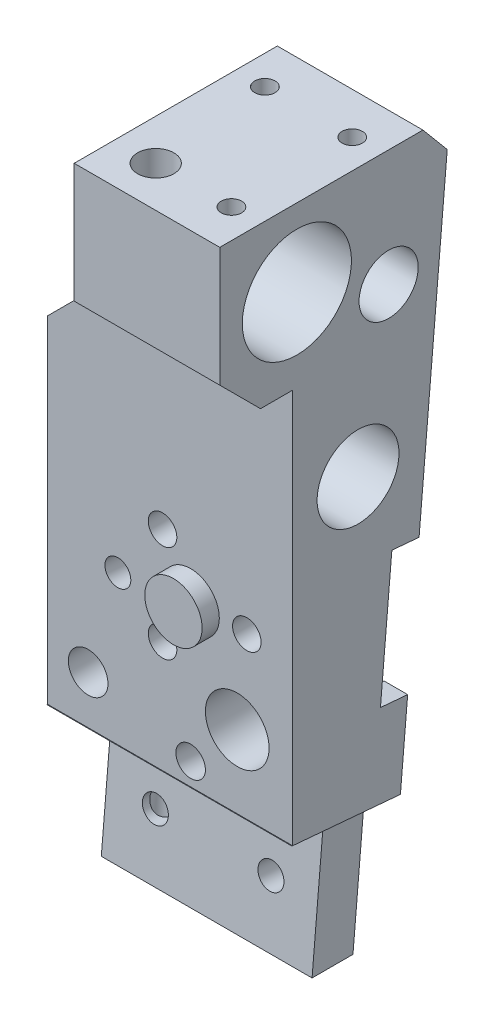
ISO-10303-21;
HEADER;
FILE_DESCRIPTION(('STEP AP214'),'2;1');
FILE_NAME('part.step','',(''),(''),'','','');
FILE_SCHEMA(('AUTOMOTIVE_DESIGN { 1 0 10303 214 1 1 1 1 }'));
ENDSEC;
DATA;
#1=APPLICATION_CONTEXT('core data for automotive mechanical design processes');
#2=APPLICATION_PROTOCOL_DEFINITION('international standard','automotive_design',2000,#1);
#3=PRODUCT_CONTEXT('',#1,'mechanical');
#4=PRODUCT('Part','Part','',(#3));
#5=PRODUCT_RELATED_PRODUCT_CATEGORY('part','',(#4));
#6=PRODUCT_DEFINITION_FORMATION('','',#4);
#7=PRODUCT_DEFINITION_CONTEXT('part definition',#1,'design');
#8=PRODUCT_DEFINITION('design','',#6,#7);
#9=PRODUCT_DEFINITION_SHAPE('','',#8);
#10=(LENGTH_UNIT() NAMED_UNIT(*) SI_UNIT(.MILLI.,.METRE.));
#11=(NAMED_UNIT(*) PLANE_ANGLE_UNIT() SI_UNIT($,.RADIAN.));
#12=(NAMED_UNIT(*) SI_UNIT($,.STERADIAN.) SOLID_ANGLE_UNIT());
#13=UNCERTAINTY_MEASURE_WITH_UNIT(LENGTH_MEASURE(1.E-05),#10,'distance_accuracy_value','');
#14=(GEOMETRIC_REPRESENTATION_CONTEXT(3) GLOBAL_UNCERTAINTY_ASSIGNED_CONTEXT((#13)) GLOBAL_UNIT_ASSIGNED_CONTEXT((#10,
#11,#12)) REPRESENTATION_CONTEXT('',''));
#15=CARTESIAN_POINT('',(0.,0.,0.));
#16=DIRECTION('',(0.,0.,1.));
#17=DIRECTION('',(1.,0.,0.));
#18=AXIS2_PLACEMENT_3D('',#15,#16,#17);
#19=CARTESIAN_POINT('',(-12.4968,-27.83885594,13.716));
#20=DIRECTION('',(0.,1.,0.));
#21=DIRECTION('',(0.,0.,1.));
#22=AXIS2_PLACEMENT_3D('',#19,#20,#21);
#23=PLANE('',#22);
#24=DIRECTION('',(0.,0.,1.));
#25=VECTOR('',#24,1.);
#26=CARTESIAN_POINT('',(5.89000000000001,-27.83885594,5.44441953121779));
#27=LINE('',#26,#25);
#28=CARTESIAN_POINT('',(5.89000000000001,-27.83885594,5.44441953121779));
#29=VERTEX_POINT('',#28);
#30=CARTESIAN_POINT('',(5.89000000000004,-27.83885594,9.01400287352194));
#31=VERTEX_POINT('',#30);
#32=EDGE_CURVE('E1393',#29,#31,#27,.T.);
#33=ORIENTED_EDGE('',*,*,#32,.T.);
#34=DIRECTION('',(1.,0.,0.));
#35=VECTOR('',#34,1.);
#36=CARTESIAN_POINT('',(-12.4968,-27.83885594,9.01400287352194));
#37=LINE('',#36,#35);
#38=CARTESIAN_POINT('',(-12.4968,-27.83885594,9.01400287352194));
#39=VERTEX_POINT('',#38);
#40=EDGE_CURVE('E1403',#39,#31,#37,.T.);
#41=ORIENTED_EDGE('',*,*,#40,.F.);
#42=DIRECTION('',(0.,0.,-1.));
#43=VECTOR('',#42,1.);
#44=CARTESIAN_POINT('',(-12.4968,-27.83885594,13.716));
#45=LINE('',#44,#43);
#46=CARTESIAN_POINT('',(-12.4968,-27.83885594,5.44441953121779));
#47=VERTEX_POINT('',#46);
#48=EDGE_CURVE('E557',#39,#47,#45,.T.);
#49=ORIENTED_EDGE('',*,*,#48,.T.);
#50=DIRECTION('',(1.,0.,0.));
#51=VECTOR('',#50,1.);
#52=CARTESIAN_POINT('',(-12.4968,-27.83885594,5.44441953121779));
#53=LINE('',#52,#51);
#54=EDGE_CURVE('E816',#47,#29,#53,.T.);
#55=ORIENTED_EDGE('',*,*,#54,.T.);
#56=EDGE_LOOP('',(#33,#41,#49,#55));
#57=FACE_BOUND('',#56,.T.);
#58=CARTESIAN_POINT('',(-9.3218,-27.83885594,7.22921120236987));
#59=DIRECTION('',(0.,1.,0.));
#60=DIRECTION('',(0.,0.,1.));
#61=AXIS2_PLACEMENT_3D('',#58,#59,#60);
#62=ELLIPSE('',#61,1.14736607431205,1.143);
#63=CARTESIAN_POINT('',(-9.32180000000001,-27.83885594,8.37657727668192));
#64=VERTEX_POINT('',#63);
#65=EDGE_CURVE('E299',#64,#64,#62,.F.);
#66=ORIENTED_EDGE('',*,*,#65,.F.);
#67=EDGE_LOOP('',(#66));
#68=FACE_BOUND('',#67,.T.);
#69=ADVANCED_FACE('F45',(#57,#68),#23,.F.);
#70=CARTESIAN_POINT('',(8.89000000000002,-7.38864006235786,6.0456034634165));
#71=DIRECTION('',(0.,-0.996194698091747,0.0871557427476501));
#72=DIRECTION('',(0.,-0.0871557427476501,-0.996194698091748));
#73=AXIS2_PLACEMENT_3D('',#70,#71,#72);
#74=PLANE('',#73);
#75=DIRECTION('',(-1.,0.,0.));
#76=VECTOR('',#75,1.);
#77=CARTESIAN_POINT('',(8.89005000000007,-7.38841868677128,6.04813379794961));
#78=LINE('',#77,#76);
#79=CARTESIAN_POINT('',(1.2969670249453,-7.3884186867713,6.04813379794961));
#80=VERTEX_POINT('',#79);
#81=CARTESIAN_POINT('',(-12.4968,-7.38841868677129,6.04813379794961));
#82=VERTEX_POINT('',#81);
#83=EDGE_CURVE('E316',#80,#82,#78,.T.);
#84=ORIENTED_EDGE('',*,*,#83,.F.);
#85=CARTESIAN_POINT('',(4.06400000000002,-7.64343957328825,3.13323172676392));
#86=DIRECTION('',(0.,-0.996194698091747,0.0871557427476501));
#87=DIRECTION('',(0.,0.08715574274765,0.996194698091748));
#88=AXIS2_PLACEMENT_3D('',#85,#86,#87);
#89=ELLIPSE('',#88,31.8826954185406,2.77876);
#90=CARTESIAN_POINT('',(1.28564191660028,-7.59617967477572,3.67341483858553));
#91=VERTEX_POINT('',#90);
#92=EDGE_CURVE('E70',#80,#91,#89,.T.);
#93=ORIENTED_EDGE('',*,*,#92,.T.);
#94=DIRECTION('',(-1.,0.,0.));
#95=VECTOR('',#94,1.);
#96=CARTESIAN_POINT('',(8.89000000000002,-7.59617967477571,3.67341483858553));
#97=LINE('',#96,#95);
#98=CARTESIAN_POINT('',(-12.4968,-7.59617967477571,3.67341483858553));
#99=VERTEX_POINT('',#98);
#100=EDGE_CURVE('E1371',#91,#99,#97,.T.);
#101=ORIENTED_EDGE('',*,*,#100,.T.);
#102=DIRECTION('',(0.,0.08715574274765,0.996194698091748));
#103=VECTOR('',#102,1.);
#104=CARTESIAN_POINT('',(-12.4968,-7.38864006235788,6.0456034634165));
#105=LINE('',#104,#103);
#106=EDGE_CURVE('E1363',#99,#82,#105,.T.);
#107=ORIENTED_EDGE('',*,*,#106,.T.);
#108=EDGE_LOOP('',(#84,#93,#101,#107));
#109=FACE_BOUND('',#108,.T.);
#110=ADVANCED_FACE('F661',(#109),#74,.F.);
#111=CARTESIAN_POINT('',(-12.4968,34.39114406,13.716));
#112=DIRECTION('',(1.,0.,0.));
#113=DIRECTION('',(0.,1.,0.));
#114=AXIS2_PLACEMENT_3D('',#111,#112,#113);
#115=PLANE('',#114);
#116=CARTESIAN_POINT('',(-12.4968,11.02314406,8.00100000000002));
#117=DIRECTION('',(1.,0.,0.));
#118=DIRECTION('',(0.,1.,0.));
#119=AXIS2_PLACEMENT_3D('',#116,#117,#118);
#120=CIRCLE('',#119,3.571875);
#121=CARTESIAN_POINT('',(-12.4968,14.59501906,8.00100000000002));
#122=VERTEX_POINT('',#121);
#123=EDGE_CURVE('E351',#122,#122,#120,.T.);
#124=ORIENTED_EDGE('',*,*,#123,.T.);
#125=EDGE_LOOP('',(#124));
#126=FACE_BOUND('',#125,.T.);
#127=DIRECTION('',(0.,-0.087155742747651,-0.996194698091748));
#128=VECTOR('',#127,1.);
#129=CARTESIAN_POINT('',(-12.4968,3.79032572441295,2.67722469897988));
#130=LINE('',#129,#128);
#131=CARTESIAN_POINT('',(-12.4968,3.99808671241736,5.05194365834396));
#132=VERTEX_POINT('',#131);
#133=CARTESIAN_POINT('',(-12.4968,3.79032572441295,2.67722469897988));
#134=VERTEX_POINT('',#133);
#135=EDGE_CURVE('E718',#132,#134,#130,.T.);
#136=ORIENTED_EDGE('',*,*,#135,.F.);
#137=DIRECTION('',(0.,0.996194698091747,-0.0871557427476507));
#138=VECTOR('',#137,1.);
#139=CARTESIAN_POINT('',(-12.4968,3.99808671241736,5.05194365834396));
#140=LINE('',#139,#138);
#141=EDGE_CURVE('E312',#82,#132,#140,.T.);
#142=ORIENTED_EDGE('',*,*,#141,.F.);
#143=ORIENTED_EDGE('',*,*,#106,.F.);
#144=DIRECTION('',(0.,-0.996194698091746,0.0871557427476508));
#145=VECTOR('',#144,1.);
#146=CARTESIAN_POINT('',(-12.4968,-27.83885594,5.44441953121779));
#147=LINE('',#146,#145);
#148=EDGE_CURVE('E868',#99,#47,#147,.T.);
#149=ORIENTED_EDGE('',*,*,#148,.T.);
#150=ORIENTED_EDGE('',*,*,#48,.F.);
#151=DIRECTION('',(0.,0.996194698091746,-0.0871557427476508));
#152=VECTOR('',#151,1.);
#153=CARTESIAN_POINT('',(-12.4968,-13.8790792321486,7.7926806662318));
#154=LINE('',#153,#152);
#155=CARTESIAN_POINT('',(-12.4968,-14.5116628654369,7.84802456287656));
#156=VERTEX_POINT('',#155);
#157=EDGE_CURVE('E1399',#39,#156,#154,.T.);
#158=ORIENTED_EDGE('',*,*,#157,.T.);
#159=DIRECTION('',(0.,-0.0871557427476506,-0.996194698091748));
#160=VECTOR('',#159,1.);
#161=CARTESIAN_POINT('',(-12.4968,-13.9934395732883,13.7713438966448));
#162=LINE('',#161,#160);
#163=CARTESIAN_POINT('',(-12.4968,-13.9934395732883,13.7713438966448));
#164=VERTEX_POINT('',#163);
#165=EDGE_CURVE('E374',#164,#156,#162,.T.);
#166=ORIENTED_EDGE('',*,*,#165,.F.);
#167=DIRECTION('',(0.,0.,-1.));
#168=VECTOR('',#167,1.);
#169=CARTESIAN_POINT('',(-12.4968,-13.9934395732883,20.066025));
#170=LINE('',#169,#168);
#171=CARTESIAN_POINT('',(-12.4968,-13.9934395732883,13.716));
#172=VERTEX_POINT('',#171);
#173=EDGE_CURVE('E362',#164,#172,#170,.T.);
#174=ORIENTED_EDGE('',*,*,#173,.T.);
#175=DIRECTION('',(0.,-1.,0.));
#176=VECTOR('',#175,1.);
#177=CARTESIAN_POINT('',(-12.4968,34.39114406,13.716));
#178=LINE('',#177,#176);
#179=CARTESIAN_POINT('',(-12.4968,15.34114406,13.716));
#180=VERTEX_POINT('',#179);
#181=EDGE_CURVE('E811',#180,#172,#178,.T.);
#182=ORIENTED_EDGE('',*,*,#181,.F.);
#183=DIRECTION('',(0.,0.,-1.));
#184=VECTOR('',#183,1.);
#185=CARTESIAN_POINT('',(-12.4968,15.34114406,1.22221662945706));
#186=LINE('',#185,#184);
#187=CARTESIAN_POINT('',(-12.4968,15.34114406,1.66665904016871));
#188=VERTEX_POINT('',#187);
#189=EDGE_CURVE('E804',#180,#188,#186,.T.);
#190=ORIENTED_EDGE('',*,*,#189,.T.);
#191=EDGE_CURVE('E867',#188,#134,#147,.T.);
#192=ORIENTED_EDGE('',*,*,#191,.T.);
#193=EDGE_LOOP('',(#136,#142,#143,#149,#150,#158,#166,#174,#182,#190,#192));
#194=FACE_BOUND('',#193,.T.);
#195=ADVANCED_FACE('F667',(#126,#194),#115,.F.);
#196=CARTESIAN_POINT('',(8.89000000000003,34.39114406,13.716));
#197=DIRECTION('',(-1.,0.,0.));
#198=DIRECTION('',(0.,-1.,0.));
#199=AXIS2_PLACEMENT_3D('',#196,#197,#198);
#200=PLANE('',#199);
#201=CARTESIAN_POINT('',(8.89000000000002,24.23114406,5.334));
#202=DIRECTION('',(-1.,0.,0.));
#203=DIRECTION('',(0.,-1.,0.));
#204=AXIS2_PLACEMENT_3D('',#201,#202,#203);
#205=CIRCLE('',#204,2.579751);
#206=CARTESIAN_POINT('',(8.89000000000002,21.65139306,5.334));
#207=VERTEX_POINT('',#206);
#208=EDGE_CURVE('E346',#207,#207,#205,.T.);
#209=ORIENTED_EDGE('',*,*,#208,.T.);
#210=EDGE_LOOP('',(#209));
#211=FACE_BOUND('',#210,.T.);
#212=CARTESIAN_POINT('',(8.89,11.02314406,8.00100000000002));
#213=DIRECTION('',(1.,0.,0.));
#214=DIRECTION('',(0.,0.,-1.));
#215=AXIS2_PLACEMENT_3D('',#212,#213,#214);
#216=CIRCLE('',#215,3.571875);
#217=CARTESIAN_POINT('',(8.89,11.02314406,4.42912500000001));
#218=VERTEX_POINT('',#217);
#219=EDGE_CURVE('E347',#218,#218,#216,.T.);
#220=ORIENTED_EDGE('',*,*,#219,.F.);
#221=EDGE_LOOP('',(#220));
#222=FACE_BOUND('',#221,.T.);
#223=CARTESIAN_POINT('',(8.88999999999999,27.6464314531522,13.33859782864));
#224=DIRECTION('',(-1.,0.,0.));
#225=DIRECTION('',(0.,-1.,0.));
#226=AXIS2_PLACEMENT_3D('',#223,#224,#225);
#227=CIRCLE('',#226,4.75869);
#228=CARTESIAN_POINT('',(8.88999999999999,22.8877414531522,13.33859782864));
#229=VERTEX_POINT('',#228);
#230=EDGE_CURVE('E495',#229,#229,#227,.T.);
#231=ORIENTED_EDGE('',*,*,#230,.T.);
#232=EDGE_LOOP('',(#231));
#233=FACE_BOUND('',#232,.T.);
#234=DIRECTION('',(0.,0.996194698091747,-0.0871557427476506));
#235=VECTOR('',#234,1.);
#236=CARTESIAN_POINT('',(8.89000000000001,33.4080258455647,2.47890738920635));
#237=LINE('',#236,#235);
#238=CARTESIAN_POINT('',(8.89000000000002,-7.38841868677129,6.04813379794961));
#239=VERTEX_POINT('',#238);
#240=CARTESIAN_POINT('',(8.89000000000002,3.99808671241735,5.05194365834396));
#241=VERTEX_POINT('',#240);
#242=EDGE_CURVE('E338',#239,#241,#237,.T.);
#243=ORIENTED_EDGE('',*,*,#242,.T.);
#244=DIRECTION('',(0.,-0.087155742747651,-0.996194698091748));
#245=VECTOR('',#244,1.);
#246=CARTESIAN_POINT('',(8.89000000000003,3.79032572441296,2.67722469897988));
#247=LINE('',#246,#245);
#248=CARTESIAN_POINT('',(8.89000000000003,3.79032572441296,2.67722469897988));
#249=VERTEX_POINT('',#248);
#250=EDGE_CURVE('E531',#241,#249,#247,.T.);
#251=ORIENTED_EDGE('',*,*,#250,.T.);
#252=DIRECTION('',(0.,-0.996194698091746,0.0871557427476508));
#253=VECTOR('',#252,1.);
#254=CARTESIAN_POINT('',(8.89000000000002,-27.83885594,5.44441953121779));
#255=LINE('',#254,#253);
#256=CARTESIAN_POINT('',(8.89000000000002,31.860809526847,0.221375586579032));
#257=VERTEX_POINT('',#256);
#258=EDGE_CURVE('E1407',#257,#249,#255,.T.);
#259=ORIENTED_EDGE('',*,*,#258,.F.);
#260=DIRECTION('',(0.,-0.766044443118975,-0.642787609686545));
#261=VECTOR('',#260,1.);
#262=CARTESIAN_POINT('',(8.89000000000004,34.39114406,2.34457836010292));
#263=LINE('',#262,#261);
#264=CARTESIAN_POINT('',(8.89000000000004,34.39114406,2.34457836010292));
#265=VERTEX_POINT('',#264);
#266=EDGE_CURVE('E695',#257,#265,#263,.F.);
#267=ORIENTED_EDGE('',*,*,#266,.T.);
#268=DIRECTION('',(0.,0.,-1.));
#269=VECTOR('',#268,1.);
#270=CARTESIAN_POINT('',(8.89000000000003,34.39114406,13.716));
#271=LINE('',#270,#269);
#272=CARTESIAN_POINT('',(8.89000000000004,34.39114406,20.066));
#273=VERTEX_POINT('',#272);
#274=EDGE_CURVE('E823',#273,#265,#271,.T.);
#275=ORIENTED_EDGE('',*,*,#274,.F.);
#276=DIRECTION('',(0.,1.,0.));
#277=VECTOR('',#276,1.);
#278=CARTESIAN_POINT('',(8.89000000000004,34.39114406,20.066));
#279=LINE('',#278,#277);
#280=CARTESIAN_POINT('',(8.89000000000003,23.97714406,20.066));
#281=VERTEX_POINT('',#280);
#282=EDGE_CURVE('E520',#281,#273,#279,.T.);
#283=ORIENTED_EDGE('',*,*,#282,.F.);
#284=DIRECTION('',(0.,0.707106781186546,0.70710678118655));
#285=VECTOR('',#284,1.);
#286=CARTESIAN_POINT('',(8.89000000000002,23.97714406,20.066));
#287=LINE('',#286,#285);
#288=CARTESIAN_POINT('',(8.89,20.42114406,16.51));
#289=VERTEX_POINT('',#288);
#290=EDGE_CURVE('E709',#281,#289,#287,.F.);
#291=ORIENTED_EDGE('',*,*,#290,.T.);
#292=DIRECTION('',(0.,0.,-1.));
#293=VECTOR('',#292,1.);
#294=CARTESIAN_POINT('',(8.89,20.42114406,20.066));
#295=LINE('',#294,#293);
#296=CARTESIAN_POINT('',(8.89,20.42114406,13.716));
#297=VERTEX_POINT('',#296);
#298=EDGE_CURVE('E528',#289,#297,#295,.T.);
#299=ORIENTED_EDGE('',*,*,#298,.T.);
#300=DIRECTION('',(0.,1.,0.));
#301=VECTOR('',#300,1.);
#302=CARTESIAN_POINT('',(8.89000000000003,34.39114406,13.716));
#303=LINE('',#302,#301);
#304=CARTESIAN_POINT('',(8.89000000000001,-13.9934395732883,13.716));
#305=VERTEX_POINT('',#304);
#306=EDGE_CURVE('E815',#305,#297,#303,.T.);
#307=ORIENTED_EDGE('',*,*,#306,.F.);
#308=DIRECTION('',(0.,0.,-1.));
#309=VECTOR('',#308,1.);
#310=CARTESIAN_POINT('',(8.89000000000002,-13.9934395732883,20.066025));
#311=LINE('',#310,#309);
#312=CARTESIAN_POINT('',(8.89000000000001,-13.9934395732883,13.7713438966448));
#313=VERTEX_POINT('',#312);
#314=EDGE_CURVE('E359',#313,#305,#311,.T.);
#315=ORIENTED_EDGE('',*,*,#314,.F.);
#316=DIRECTION('',(0.,0.0871557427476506,0.996194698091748));
#317=VECTOR('',#316,1.);
#318=CARTESIAN_POINT('',(8.89000000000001,-13.9934395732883,13.7713438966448));
#319=LINE('',#318,#317);
#320=CARTESIAN_POINT('',(8.89,-14.8215886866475,4.3055562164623));
#321=VERTEX_POINT('',#320);
#322=EDGE_CURVE('E366',#321,#313,#319,.T.);
#323=ORIENTED_EDGE('',*,*,#322,.F.);
#324=CARTESIAN_POINT('',(8.89000000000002,-7.59617967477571,3.67341483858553));
#325=VERTEX_POINT('',#324);
#326=EDGE_CURVE('E1406',#325,#321,#255,.T.);
#327=ORIENTED_EDGE('',*,*,#326,.F.);
#328=DIRECTION('',(0.,0.08715574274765,0.996194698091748));
#329=VECTOR('',#328,1.);
#330=CARTESIAN_POINT('',(8.89000000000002,-7.38864006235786,6.0456034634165));
#331=LINE('',#330,#329);
#332=EDGE_CURVE('E1378',#325,#239,#331,.T.);
#333=ORIENTED_EDGE('',*,*,#332,.T.);
#334=EDGE_LOOP('',(#243,#251,#259,#267,#275,#283,#291,#299,#307,#315,#323,#327,#333));
#335=FACE_BOUND('',#334,.T.);
#336=ADVANCED_FACE('F675',(#211,#222,#233,#335),#200,.F.);
#337=CARTESIAN_POINT('',(-12.4968,-13.8790792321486,7.7926806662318));
#338=DIRECTION('',(0.,-0.0871557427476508,-0.996194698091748));
#339=DIRECTION('',(0.,0.996194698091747,-0.0871557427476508));
#340=AXIS2_PLACEMENT_3D('',#337,#338,#339);
#341=PLANE('',#340);
#342=CARTESIAN_POINT('',(1.826,-22.3742852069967,8.53591488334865));
#343=DIRECTION('',(0.,0.0871557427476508,0.996194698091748));
#344=DIRECTION('',(0.,-0.996194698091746,0.0871557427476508));
#345=AXIS2_PLACEMENT_3D('',#342,#343,#344);
#346=CIRCLE('',#345,1.13029999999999);
#347=CARTESIAN_POINT('',(1.826,-23.5002840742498,8.63442701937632));
#348=VERTEX_POINT('',#347);
#349=EDGE_CURVE('E471',#348,#348,#346,.T.);
#350=ORIENTED_EDGE('',*,*,#349,.F.);
#351=EDGE_LOOP('',(#350));
#352=FACE_BOUND('',#351,.T.);
#353=CARTESIAN_POINT('',(-8.25800000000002,-22.3742852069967,8.53591488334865));
#354=DIRECTION('',(0.,0.0871557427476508,0.996194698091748));
#355=DIRECTION('',(0.,-0.996194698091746,0.0871557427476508));
#356=AXIS2_PLACEMENT_3D('',#353,#354,#355);
#357=CIRCLE('',#356,1.13029999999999);
#358=CARTESIAN_POINT('',(-8.25800000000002,-23.5002840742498,8.63442701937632));
#359=VERTEX_POINT('',#358);
#360=EDGE_CURVE('E462',#359,#359,#357,.T.);
#361=ORIENTED_EDGE('',*,*,#360,.F.);
#362=EDGE_LOOP('',(#361));
#363=FACE_BOUND('',#362,.T.);
#364=DIRECTION('',(1.,0.,0.));
#365=VECTOR('',#364,1.);
#366=CARTESIAN_POINT('',(-12.4968,-14.5116628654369,7.84802456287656));
#367=LINE('',#366,#365);
#368=CARTESIAN_POINT('',(5.89000000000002,-14.5116628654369,7.84802456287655));
#369=VERTEX_POINT('',#368);
#370=EDGE_CURVE('E377',#156,#369,#367,.T.);
#371=ORIENTED_EDGE('',*,*,#370,.F.);
#372=ORIENTED_EDGE('',*,*,#157,.F.);
#373=ORIENTED_EDGE('',*,*,#40,.T.);
#374=DIRECTION('',(0.,0.996194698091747,-0.0871557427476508));
#375=VECTOR('',#374,1.);
#376=CARTESIAN_POINT('',(5.89000000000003,-27.83885594,9.01400287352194));
#377=LINE('',#376,#375);
#378=EDGE_CURVE('E1384',#31,#369,#377,.T.);
#379=ORIENTED_EDGE('',*,*,#378,.T.);
#380=EDGE_LOOP('',(#371,#372,#373,#379));
#381=FACE_BOUND('',#380,.T.);
#382=ADVANCED_FACE('F1130',(#352,#363,#381),#341,.F.);
#383=CARTESIAN_POINT('',(5.89000000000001,-15.5535351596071,23.4923611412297));
#384=DIRECTION('',(1.,0.,0.));
#385=DIRECTION('',(0.,1.,0.));
#386=AXIS2_PLACEMENT_3D('',#383,#384,#385);
#387=PLANE('',#386);
#388=DIRECTION('',(0.,-0.996194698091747,0.0871557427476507));
#389=VECTOR('',#388,1.);
#390=CARTESIAN_POINT('',(5.89000000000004,-27.83885594,5.44441953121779));
#391=LINE('',#390,#389);
#392=CARTESIAN_POINT('',(5.89000000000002,-14.8215886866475,4.3055562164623));
#393=VERTEX_POINT('',#392);
#394=EDGE_CURVE('E1396',#393,#29,#391,.T.);
#395=ORIENTED_EDGE('',*,*,#394,.F.);
#396=DIRECTION('',(0.,-0.0871557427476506,-0.996194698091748));
#397=VECTOR('',#396,1.);
#398=CARTESIAN_POINT('',(5.89000000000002,-14.5116628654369,7.84802456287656));
#399=LINE('',#398,#397);
#400=EDGE_CURVE('E380',#369,#393,#399,.T.);
#401=ORIENTED_EDGE('',*,*,#400,.F.);
#402=ORIENTED_EDGE('',*,*,#378,.F.);
#403=ORIENTED_EDGE('',*,*,#32,.F.);
#404=EDGE_LOOP('',(#395,#401,#402,#403));
#405=FACE_BOUND('',#404,.T.);
#406=ADVANCED_FACE('F1133',(#405),#387,.T.);
#407=CARTESIAN_POINT('',(8.89000000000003,3.79032572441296,2.67722469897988));
#408=DIRECTION('',(0.,0.996194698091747,-0.087155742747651));
#409=DIRECTION('',(0.,0.087155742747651,0.996194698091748));
#410=AXIS2_PLACEMENT_3D('',#407,#408,#409);
#411=PLANE('',#410);
#412=DIRECTION('',(-1.,0.,0.));
#413=VECTOR('',#412,1.);
#414=CARTESIAN_POINT('',(8.89000000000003,3.79032572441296,2.67722469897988));
#415=LINE('',#414,#413);
#416=CARTESIAN_POINT('',(-4.638773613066,3.79032572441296,2.67722469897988));
#417=VERTEX_POINT('',#416);
#418=EDGE_CURVE('E1389',#417,#134,#415,.T.);
#419=ORIENTED_EDGE('',*,*,#418,.F.);
#420=CARTESIAN_POINT('',(-2.44999999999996,4.24352447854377,7.857310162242));
#421=DIRECTION('',(0.,0.996194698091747,-0.087155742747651));
#422=DIRECTION('',(0.,-0.087155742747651,-0.996194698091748));
#423=AXIS2_PLACEMENT_3D('',#420,#421,#422);
#424=ELLIPSE('',#423,25.6460438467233,2.2352);
#425=CARTESIAN_POINT('',(-4.67168389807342,3.99808671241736,5.05194365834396));
#426=VERTEX_POINT('',#425);
#427=EDGE_CURVE('E80',#417,#426,#424,.T.);
#428=ORIENTED_EDGE('',*,*,#427,.T.);
#429=DIRECTION('',(-1.,0.,0.));
#430=VECTOR('',#429,1.);
#431=CARTESIAN_POINT('',(8.89005000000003,3.99808671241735,5.05194365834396));
#432=LINE('',#431,#430);
#433=EDGE_CURVE('E317',#426,#132,#432,.T.);
#434=ORIENTED_EDGE('',*,*,#433,.T.);
#435=ORIENTED_EDGE('',*,*,#135,.T.);
#436=EDGE_LOOP('',(#419,#428,#434,#435));
#437=FACE_BOUND('',#436,.T.);
#438=ADVANCED_FACE('F963',(#437),#411,.F.);
#439=CARTESIAN_POINT('',(-12.4968,-27.83885594,13.716));
#440=DIRECTION('',(0.,0.,1.));
#441=DIRECTION('',(1.,0.,0.));
#442=AXIS2_PLACEMENT_3D('',#439,#440,#441);
#443=PLANE('',#442);
#444=CARTESIAN_POINT('',(4.06400000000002,-7.64343957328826,13.716));
#445=DIRECTION('',(0.,0.,1.));
#446=DIRECTION('',(1.,0.,0.));
#447=AXIS2_PLACEMENT_3D('',#444,#445,#446);
#448=CIRCLE('',#447,2.77876);
#449=CARTESIAN_POINT('',(6.84276000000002,-7.64343957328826,13.716));
#450=VERTEX_POINT('',#449);
#451=EDGE_CURVE('E300',#450,#450,#448,.T.);
#452=ORIENTED_EDGE('',*,*,#451,.F.);
#453=EDGE_LOOP('',(#452));
#454=FACE_BOUND('',#453,.T.);
#455=CARTESIAN_POINT('',(-8.94080000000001,-9.80485593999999,13.716));
#456=DIRECTION('',(0.,0.,1.));
#457=DIRECTION('',(1.,0.,0.));
#458=AXIS2_PLACEMENT_3D('',#455,#456,#457);
#459=CIRCLE('',#458,1.72719999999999);
#460=CARTESIAN_POINT('',(-7.21360000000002,-9.80485593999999,13.716));
#461=VERTEX_POINT('',#460);
#462=EDGE_CURVE('E387',#461,#461,#459,.T.);
#463=ORIENTED_EDGE('',*,*,#462,.F.);
#464=EDGE_LOOP('',(#463));
#465=FACE_BOUND('',#464,.T.);
#466=CARTESIAN_POINT('',(-6.34999999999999,-0.980736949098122,13.716));
#467=DIRECTION('',(0.,0.,1.));
#468=DIRECTION('',(0.,-1.,0.));
#469=AXIS2_PLACEMENT_3D('',#466,#467,#468);
#470=ELLIPSE('',#469,1.13461756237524,1.13029999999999);
#471=CARTESIAN_POINT('',(-6.34999999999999,-2.11535451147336,13.716));
#472=VERTEX_POINT('',#471);
#473=EDGE_CURVE('E423',#472,#472,#470,.T.);
#474=ORIENTED_EDGE('',*,*,#473,.F.);
#475=EDGE_LOOP('',(#474));
#476=FACE_BOUND('',#475,.T.);
#477=CARTESIAN_POINT('',(-2.45000000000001,-4.24352447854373,13.716));
#478=DIRECTION('',(0.,0.,1.));
#479=DIRECTION('',(1.,0.,0.));
#480=AXIS2_PLACEMENT_3D('',#477,#478,#479);
#481=CIRCLE('',#480,1.2446);
#482=CARTESIAN_POINT('',(-1.20540000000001,-4.24352447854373,13.716));
#483=VERTEX_POINT('',#482);
#484=EDGE_CURVE('E435',#483,#483,#481,.T.);
#485=ORIENTED_EDGE('',*,*,#484,.F.);
#486=EDGE_LOOP('',(#485));
#487=FACE_BOUND('',#486,.T.);
#488=CARTESIAN_POINT('',(-2.44999999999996,4.24352447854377,13.716));
#489=DIRECTION('',(0.,0.,1.));
#490=DIRECTION('',(1.,0.,0.));
#491=AXIS2_PLACEMENT_3D('',#488,#489,#490);
#492=CIRCLE('',#491,1.2446);
#493=CARTESIAN_POINT('',(-1.20539999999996,4.24352447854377,13.716));
#494=VERTEX_POINT('',#493);
#495=EDGE_CURVE('E448',#494,#494,#492,.T.);
#496=ORIENTED_EDGE('',*,*,#495,.F.);
#497=EDGE_LOOP('',(#496));
#498=FACE_BOUND('',#497,.T.);
#499=CARTESIAN_POINT('',(4.9,0.,13.716));
#500=DIRECTION('',(0.,0.,1.));
#501=DIRECTION('',(1.,0.,0.));
#502=AXIS2_PLACEMENT_3D('',#499,#500,#501);
#503=CIRCLE('',#502,1.2446);
#504=CARTESIAN_POINT('',(6.1446,0.,13.716));
#505=VERTEX_POINT('',#504);
#506=EDGE_CURVE('E457',#505,#505,#503,.T.);
#507=ORIENTED_EDGE('',*,*,#506,.F.);
#508=EDGE_LOOP('',(#507));
#509=FACE_BOUND('',#508,.T.);
#510=DIRECTION('',(1.,0.,0.));
#511=VECTOR('',#510,1.);
#512=CARTESIAN_POINT('',(8.89,20.42114406,13.716));
#513=LINE('',#512,#511);
#514=CARTESIAN_POINT('',(-7.41679999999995,20.42114406,13.716));
#515=VERTEX_POINT('',#514);
#516=CARTESIAN_POINT('',(-3.81,20.42114406,13.716));
#517=VERTEX_POINT('',#516);
#518=EDGE_CURVE('E524',#515,#517,#513,.T.);
#519=ORIENTED_EDGE('',*,*,#518,.F.);
#520=DIRECTION('',(-0.707106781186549,-0.707106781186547,0.));
#521=VECTOR('',#520,1.);
#522=CARTESIAN_POINT('',(-34.0868,-6.24885593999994,13.716));
#523=LINE('',#522,#521);
#524=EDGE_CURVE('E863',#515,#180,#523,.T.);
#525=ORIENTED_EDGE('',*,*,#524,.T.);
#526=ORIENTED_EDGE('',*,*,#181,.T.);
#527=DIRECTION('',(1.,0.,0.));
#528=VECTOR('',#527,1.);
#529=CARTESIAN_POINT('',(8.89000000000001,-13.9934395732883,13.716));
#530=LINE('',#529,#528);
#531=EDGE_CURVE('E355',#172,#305,#530,.T.);
#532=ORIENTED_EDGE('',*,*,#531,.T.);
#533=ORIENTED_EDGE('',*,*,#306,.T.);
#534=EDGE_CURVE('E519',#517,#297,#513,.T.);
#535=ORIENTED_EDGE('',*,*,#534,.F.);
#536=EDGE_LOOP('',(#519,#525,#526,#532,#533,#535));
#537=FACE_BOUND('',#536,.T.);
#538=CARTESIAN_POINT('',(0.,-12.057888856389,13.716));
#539=DIRECTION('',(0.,0.,1.));
#540=DIRECTION('',(0.,-1.,0.));
#541=AXIS2_PLACEMENT_3D('',#538,#539,#540);
#542=ELLIPSE('',#541,1.29397396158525,1.28905);
#543=CARTESIAN_POINT('',(0.,-13.3518628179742,13.716));
#544=VERTEX_POINT('',#543);
#545=EDGE_CURVE('E487',#544,#544,#542,.T.);
#546=ORIENTED_EDGE('',*,*,#545,.F.);
#547=EDGE_LOOP('',(#546));
#548=FACE_BOUND('',#547,.T.);
#549=CARTESIAN_POINT('',(0.,0.,13.716));
#550=DIRECTION('',(0.,0.,1.));
#551=DIRECTION('',(1.,0.,0.));
#552=AXIS2_PLACEMENT_3D('',#549,#550,#551);
#553=CIRCLE('',#552,2.50063);
#554=CARTESIAN_POINT('',(2.50063,0.,13.716));
#555=VERTEX_POINT('',#554);
#556=EDGE_CURVE('E463',#555,#555,#553,.T.);
#557=ORIENTED_EDGE('',*,*,#556,.F.);
#558=EDGE_LOOP('',(#557));
#559=FACE_BOUND('',#558,.T.);
#560=ADVANCED_FACE('F958',(#454,#465,#476,#487,#498,#509,#537,#548,#559),#443,.T.);
#561=CARTESIAN_POINT('',(-12.4968,-27.83885594,5.44441953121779));
#562=DIRECTION('',(0.,0.0871557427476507,0.996194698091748));
#563=DIRECTION('',(0.,-0.996194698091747,0.0871557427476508));
#564=AXIS2_PLACEMENT_3D('',#561,#562,#563);
#565=PLANE('',#564);
#566=CARTESIAN_POINT('',(0.,16.9899054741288,1.52241110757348));
#567=DIRECTION('',(0.,-0.0871557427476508,-0.996194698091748));
#568=DIRECTION('',(0.,0.996194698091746,-0.0871557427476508));
#569=AXIS2_PLACEMENT_3D('',#566,#567,#568);
#570=CIRCLE('',#569,1.28905);
#571=CARTESIAN_POINT('',(0.,18.274050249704,1.41006299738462));
#572=VERTEX_POINT('',#571);
#573=EDGE_CURVE('E480',#572,#572,#570,.T.);
#574=ORIENTED_EDGE('',*,*,#573,.F.);
#575=EDGE_LOOP('',(#574));
#576=FACE_BOUND('',#575,.T.);
#577=DIRECTION('',(0.,0.996194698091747,-0.0871557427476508));
#578=VECTOR('',#577,1.);
#579=CARTESIAN_POINT('',(-3.81000000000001,-27.83885594,5.44441953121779));
#580=LINE('',#579,#578);
#581=CARTESIAN_POINT('',(-3.81000000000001,20.42114406,1.22221662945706));
#582=VERTEX_POINT('',#581);
#583=CARTESIAN_POINT('',(-3.80999999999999,31.860809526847,0.221375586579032));
#584=VERTEX_POINT('',#583);
#585=EDGE_CURVE('E511',#582,#584,#580,.T.);
#586=ORIENTED_EDGE('',*,*,#585,.T.);
#587=DIRECTION('',(1.,0.,0.));
#588=VECTOR('',#587,1.);
#589=CARTESIAN_POINT('',(-12.4968,31.860809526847,0.221375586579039));
#590=LINE('',#589,#588);
#591=EDGE_CURVE('E696',#584,#257,#590,.T.);
#592=ORIENTED_EDGE('',*,*,#591,.T.);
#593=ORIENTED_EDGE('',*,*,#258,.T.);
#594=CARTESIAN_POINT('',(-0.261226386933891,3.79032572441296,2.67722469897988));
#595=VERTEX_POINT('',#594);
#596=EDGE_CURVE('E1385',#249,#595,#415,.T.);
#597=ORIENTED_EDGE('',*,*,#596,.T.);
#598=CARTESIAN_POINT('',(-2.44999999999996,4.24352447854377,2.63757494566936));
#599=DIRECTION('',(0.,0.0871557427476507,0.996194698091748));
#600=DIRECTION('',(0.,0.996194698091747,-0.0871557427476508));
#601=AXIS2_PLACEMENT_3D('',#598,#599,#600);
#602=ELLIPSE('',#601,2.24373810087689,2.2352);
#603=EDGE_CURVE('E444',#595,#417,#602,.T.);
#604=ORIENTED_EDGE('',*,*,#603,.T.);
#605=ORIENTED_EDGE('',*,*,#418,.T.);
#606=ORIENTED_EDGE('',*,*,#191,.F.);
#607=DIRECTION('',(0.705757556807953,0.705757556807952,-0.0617457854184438));
#608=VECTOR('',#607,1.);
#609=CARTESIAN_POINT('',(-13.0218808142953,14.8160632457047,1.71259765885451));
#610=LINE('',#609,#608);
#611=CARTESIAN_POINT('',(-7.41679999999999,20.42114406,1.22221662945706));
#612=VERTEX_POINT('',#611);
#613=EDGE_CURVE('E860',#188,#612,#610,.T.);
#614=ORIENTED_EDGE('',*,*,#613,.T.);
#615=DIRECTION('',(-1.,0.,0.));
#616=VECTOR('',#615,1.);
#617=CARTESIAN_POINT('',(-12.4968,20.42114406,1.22221662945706));
#618=LINE('',#617,#616);
#619=EDGE_CURVE('E515',#582,#612,#618,.T.);
#620=ORIENTED_EDGE('',*,*,#619,.F.);
#621=EDGE_LOOP('',(#586,#592,#593,#597,#604,#605,#606,#614,#620));
#622=FACE_BOUND('',#621,.T.);
#623=ADVANCED_FACE('F962',(#576,#622),#565,.F.);
#624=CARTESIAN_POINT('',(-12.4968,34.39114406,13.716));
#625=DIRECTION('',(0.,-1.,0.));
#626=DIRECTION('',(0.,0.,-1.));
#627=AXIS2_PLACEMENT_3D('',#624,#625,#626);
#628=PLANE('',#627);
#629=CARTESIAN_POINT('',(-1.27000000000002,34.39114406,5.96899999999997));
#630=DIRECTION('',(0.,1.,0.));
#631=DIRECTION('',(0.,0.,1.));
#632=AXIS2_PLACEMENT_3D('',#629,#630,#631);
#633=CIRCLE('',#632,0.888999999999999);
#634=CARTESIAN_POINT('',(-1.27000000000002,34.39114406,6.85799999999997));
#635=VERTEX_POINT('',#634);
#636=EDGE_CURVE('E396',#635,#635,#633,.T.);
#637=ORIENTED_EDGE('',*,*,#636,.F.);
#638=EDGE_LOOP('',(#637));
#639=FACE_BOUND('',#638,.T.);
#640=CARTESIAN_POINT('',(6.35000000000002,34.39114406,5.96899999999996));
#641=DIRECTION('',(0.,1.,0.));
#642=DIRECTION('',(0.,0.,1.));
#643=AXIS2_PLACEMENT_3D('',#640,#641,#642);
#644=CIRCLE('',#643,0.888999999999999);
#645=CARTESIAN_POINT('',(6.35000000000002,34.39114406,6.85799999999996));
#646=VERTEX_POINT('',#645);
#647=EDGE_CURVE('E404',#646,#646,#644,.T.);
#648=ORIENTED_EDGE('',*,*,#647,.F.);
#649=EDGE_LOOP('',(#648));
#650=FACE_BOUND('',#649,.T.);
#651=CARTESIAN_POINT('',(6.35000000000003,34.39114406,16.51));
#652=DIRECTION('',(0.,1.,0.));
#653=DIRECTION('',(0.,0.,1.));
#654=AXIS2_PLACEMENT_3D('',#651,#652,#653);
#655=CIRCLE('',#654,0.888999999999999);
#656=CARTESIAN_POINT('',(6.35000000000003,34.39114406,17.399));
#657=VERTEX_POINT('',#656);
#658=EDGE_CURVE('E411',#657,#657,#655,.T.);
#659=ORIENTED_EDGE('',*,*,#658,.F.);
#660=EDGE_LOOP('',(#659));
#661=FACE_BOUND('',#660,.T.);
#662=CARTESIAN_POINT('',(-0.25399999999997,34.39114406,16.51));
#663=DIRECTION('',(0.,1.,0.));
#664=DIRECTION('',(0.,0.,1.));
#665=AXIS2_PLACEMENT_3D('',#662,#663,#664);
#666=CIRCLE('',#665,1.58369);
#667=CARTESIAN_POINT('',(-0.25399999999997,34.39114406,18.09369));
#668=VERTEX_POINT('',#667);
#669=EDGE_CURVE('E419',#668,#668,#666,.T.);
#670=ORIENTED_EDGE('',*,*,#669,.F.);
#671=EDGE_LOOP('',(#670));
#672=FACE_BOUND('',#671,.T.);
#673=ORIENTED_EDGE('',*,*,#274,.T.);
#674=DIRECTION('',(-1.,0.,0.));
#675=VECTOR('',#674,1.);
#676=CARTESIAN_POINT('',(-12.4968,34.39114406,2.34457836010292));
#677=LINE('',#676,#675);
#678=CARTESIAN_POINT('',(-3.81,34.3911440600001,2.34457836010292));
#679=VERTEX_POINT('',#678);
#680=EDGE_CURVE('E698',#265,#679,#677,.T.);
#681=ORIENTED_EDGE('',*,*,#680,.T.);
#682=DIRECTION('',(0.,0.,-1.));
#683=VECTOR('',#682,1.);
#684=CARTESIAN_POINT('',(-3.80999999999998,34.3911440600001,20.066));
#685=LINE('',#684,#683);
#686=CARTESIAN_POINT('',(-3.80999999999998,34.3911440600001,20.066));
#687=VERTEX_POINT('',#686);
#688=EDGE_CURVE('E499',#687,#679,#685,.T.);
#689=ORIENTED_EDGE('',*,*,#688,.F.);
#690=DIRECTION('',(-1.,0.,0.));
#691=VECTOR('',#690,1.);
#692=CARTESIAN_POINT('',(8.89000000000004,34.39114406,20.066));
#693=LINE('',#692,#691);
#694=EDGE_CURVE('E523',#273,#687,#693,.T.);
#695=ORIENTED_EDGE('',*,*,#694,.F.);
#696=EDGE_LOOP('',(#673,#681,#689,#695));
#697=FACE_BOUND('',#696,.T.);
#698=ADVANCED_FACE('F838',(#639,#650,#661,#672,#697),#628,.F.);
#699=ORIENTED_EDGE('',*,*,#100,.F.);
#700=CARTESIAN_POINT('',(4.06400000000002,-7.64343957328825,3.67754954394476));
#701=DIRECTION('',(0.,0.0871557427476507,0.996194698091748));
#702=DIRECTION('',(0.,-0.996194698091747,0.0871557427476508));
#703=AXIS2_PLACEMENT_3D('',#700,#701,#702);
#704=ELLIPSE('',#703,2.78937441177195,2.77876);
#705=CARTESIAN_POINT('',(6.84235808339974,-7.59617967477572,3.67341483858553));
#706=VERTEX_POINT('',#705);
#707=EDGE_CURVE('E308',#91,#706,#704,.T.);
#708=ORIENTED_EDGE('',*,*,#707,.T.);
#709=EDGE_CURVE('E1380',#325,#706,#97,.T.);
#710=ORIENTED_EDGE('',*,*,#709,.F.);
#711=ORIENTED_EDGE('',*,*,#326,.T.);
#712=DIRECTION('',(1.,0.,0.));
#713=VECTOR('',#712,1.);
#714=CARTESIAN_POINT('',(8.89,-14.8215886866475,4.3055562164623));
#715=LINE('',#714,#713);
#716=EDGE_CURVE('E383',#393,#321,#715,.T.);
#717=ORIENTED_EDGE('',*,*,#716,.F.);
#718=ORIENTED_EDGE('',*,*,#394,.T.);
#719=ORIENTED_EDGE('',*,*,#54,.F.);
#720=ORIENTED_EDGE('',*,*,#148,.F.);
#721=EDGE_LOOP('',(#699,#708,#710,#711,#717,#718,#719,#720));
#722=FACE_BOUND('',#721,.T.);
#723=CARTESIAN_POINT('',(-8.9408,-9.80485593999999,3.86664897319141));
#724=DIRECTION('',(0.,0.0871557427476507,0.996194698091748));
#725=DIRECTION('',(0.,-0.996194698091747,0.0871557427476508));
#726=AXIS2_PLACEMENT_3D('',#723,#724,#725);
#727=ELLIPSE('',#726,1.73379762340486,1.72719999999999);
#728=CARTESIAN_POINT('',(-8.9408,-11.53205594,4.01775939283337));
#729=VERTEX_POINT('',#728);
#730=EDGE_CURVE('E391',#729,#729,#727,.T.);
#731=ORIENTED_EDGE('',*,*,#730,.T.);
#732=EDGE_LOOP('',(#731));
#733=FACE_BOUND('',#732,.T.);
#734=CARTESIAN_POINT('',(-8.25799999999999,-22.6842110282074,4.99344653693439));
#735=DIRECTION('',(0.,0.0871557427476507,0.996194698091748));
#736=DIRECTION('',(0.,-0.996194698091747,0.0871557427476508));
#737=AXIS2_PLACEMENT_3D('',#734,#735,#736);
#738=CIRCLE('',#737,1.13029999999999);
#739=CARTESIAN_POINT('',(-8.25799999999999,-23.8102098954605,5.09195867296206));
#740=VERTEX_POINT('',#739);
#741=EDGE_CURVE('E470',#740,#740,#738,.T.);
#742=ORIENTED_EDGE('',*,*,#741,.T.);
#743=EDGE_LOOP('',(#742));
#744=FACE_BOUND('',#743,.T.);
#745=CARTESIAN_POINT('',(1.826,-22.6842110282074,4.99344653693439));
#746=DIRECTION('',(0.,0.0871557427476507,0.996194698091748));
#747=DIRECTION('',(0.,-0.996194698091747,0.0871557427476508));
#748=AXIS2_PLACEMENT_3D('',#745,#746,#747);
#749=CIRCLE('',#748,1.13029999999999);
#750=CARTESIAN_POINT('',(1.826,-23.8102098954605,5.09195867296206));
#751=VERTEX_POINT('',#750);
#752=EDGE_CURVE('E475',#751,#751,#749,.T.);
#753=ORIENTED_EDGE('',*,*,#752,.T.);
#754=EDGE_LOOP('',(#753));
#755=FACE_BOUND('',#754,.T.);
#756=CARTESIAN_POINT('',(0.,-12.8959354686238,4.13708339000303));
#757=DIRECTION('',(0.,-0.0871557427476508,-0.996194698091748));
#758=DIRECTION('',(0.,0.996194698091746,-0.0871557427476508));
#759=AXIS2_PLACEMENT_3D('',#756,#757,#758);
#760=CIRCLE('',#759,1.28905);
#761=CARTESIAN_POINT('',(0.,-11.6117906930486,4.02473527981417));
#762=VERTEX_POINT('',#761);
#763=EDGE_CURVE('E484',#762,#762,#760,.T.);
#764=ORIENTED_EDGE('',*,*,#763,.F.);
#765=EDGE_LOOP('',(#764));
#766=FACE_BOUND('',#765,.T.);
#767=ADVANCED_FACE('F1093',(#722,#733,#744,#755,#766),#565,.F.);
#768=ORIENTED_EDGE('',*,*,#250,.F.);
#769=CARTESIAN_POINT('',(-0.228316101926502,3.99808671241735,5.05194365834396));
#770=VERTEX_POINT('',#769);
#771=EDGE_CURVE('E320',#241,#770,#432,.T.);
#772=ORIENTED_EDGE('',*,*,#771,.T.);
#773=EDGE_CURVE('E553',#770,#595,#424,.T.);
#774=ORIENTED_EDGE('',*,*,#773,.T.);
#775=ORIENTED_EDGE('',*,*,#596,.F.);
#776=EDGE_LOOP('',(#768,#772,#774,#775));
#777=FACE_BOUND('',#776,.T.);
#778=ADVANCED_FACE('F1106',(#777),#411,.F.);
#779=ORIENTED_EDGE('',*,*,#709,.T.);
#780=CARTESIAN_POINT('',(6.83103297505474,-7.38841868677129,6.04813379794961));
#781=VERTEX_POINT('',#780);
#782=EDGE_CURVE('E304',#706,#781,#89,.T.);
#783=ORIENTED_EDGE('',*,*,#782,.T.);
#784=EDGE_CURVE('E321',#239,#781,#78,.T.);
#785=ORIENTED_EDGE('',*,*,#784,.F.);
#786=ORIENTED_EDGE('',*,*,#332,.F.);
#787=EDGE_LOOP('',(#779,#783,#785,#786));
#788=FACE_BOUND('',#787,.T.);
#789=ADVANCED_FACE('F670',(#788),#74,.F.);
#790=CARTESIAN_POINT('',(8.89,20.42114406,20.066));
#791=DIRECTION('',(0.,1.,0.));
#792=DIRECTION('',(0.,0.,1.));
#793=AXIS2_PLACEMENT_3D('',#790,#791,#792);
#794=PLANE('',#793);
#795=ORIENTED_EDGE('',*,*,#298,.F.);
#796=DIRECTION('',(-1.,0.,0.));
#797=VECTOR('',#796,1.);
#798=CARTESIAN_POINT('',(8.89,20.42114406,16.51));
#799=LINE('',#798,#797);
#800=CARTESIAN_POINT('',(-3.81,20.42114406,16.51));
#801=VERTEX_POINT('',#800);
#802=EDGE_CURVE('E721',#289,#801,#799,.T.);
#803=ORIENTED_EDGE('',*,*,#802,.T.);
#804=DIRECTION('',(0.,0.,1.));
#805=VECTOR('',#804,1.);
#806=CARTESIAN_POINT('',(-3.80999999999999,20.42114406,20.066));
#807=LINE('',#806,#805);
#808=EDGE_CURVE('E500',#517,#801,#807,.T.);
#809=ORIENTED_EDGE('',*,*,#808,.F.);
#810=ORIENTED_EDGE('',*,*,#534,.T.);
#811=EDGE_LOOP('',(#795,#803,#809,#810));
#812=FACE_BOUND('',#811,.T.);
#813=ADVANCED_FACE('F850',(#812),#794,.F.);
#814=CARTESIAN_POINT('',(8.89,20.42114406,20.066));
#815=DIRECTION('',(0.,0.,-1.));
#816=DIRECTION('',(-1.,0.,0.));
#817=AXIS2_PLACEMENT_3D('',#814,#815,#816);
#818=PLANE('',#817);
#819=DIRECTION('',(0.,1.,0.));
#820=VECTOR('',#819,1.);
#821=CARTESIAN_POINT('',(-3.81000000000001,-1.4444647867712,20.066));
#822=LINE('',#821,#820);
#823=CARTESIAN_POINT('',(-3.81000000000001,23.97714406,20.066));
#824=VERTEX_POINT('',#823);
#825=EDGE_CURVE('E505',#824,#687,#822,.T.);
#826=ORIENTED_EDGE('',*,*,#825,.F.);
#827=DIRECTION('',(1.,0.,0.));
#828=VECTOR('',#827,1.);
#829=CARTESIAN_POINT('',(8.89000000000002,23.97714406,20.066));
#830=LINE('',#829,#828);
#831=EDGE_CURVE('E704',#824,#281,#830,.T.);
#832=ORIENTED_EDGE('',*,*,#831,.T.);
#833=ORIENTED_EDGE('',*,*,#282,.T.);
#834=ORIENTED_EDGE('',*,*,#694,.T.);
#835=EDGE_LOOP('',(#826,#832,#833,#834));
#836=FACE_BOUND('',#835,.T.);
#837=ADVANCED_FACE('F844',(#836),#818,.F.);
#838=CARTESIAN_POINT('',(8.89,20.42114406,20.066));
#839=DIRECTION('',(0.,1.,0.));
#840=DIRECTION('',(0.,0.,1.));
#841=AXIS2_PLACEMENT_3D('',#838,#839,#840);
#842=PLANE('',#841);
#843=ORIENTED_EDGE('',*,*,#619,.T.);
#844=DIRECTION('',(0.,0.,1.));
#845=VECTOR('',#844,1.);
#846=CARTESIAN_POINT('',(-7.41679999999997,20.42114406,13.716));
#847=LINE('',#846,#845);
#848=EDGE_CURVE('E862',#612,#515,#847,.T.);
#849=ORIENTED_EDGE('',*,*,#848,.T.);
#850=ORIENTED_EDGE('',*,*,#518,.T.);
#851=EDGE_CURVE('E504',#582,#517,#807,.T.);
#852=ORIENTED_EDGE('',*,*,#851,.F.);
#853=EDGE_LOOP('',(#843,#849,#850,#852));
#854=FACE_BOUND('',#853,.T.);
#855=ADVANCED_FACE('F947',(#854),#842,.T.);
#856=CARTESIAN_POINT('',(-3.81000000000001,-1.4444647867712,20.066));
#857=DIRECTION('',(1.,0.,0.));
#858=DIRECTION('',(0.,0.,-1.));
#859=AXIS2_PLACEMENT_3D('',#856,#857,#858);
#860=PLANE('',#859);
#861=CARTESIAN_POINT('',(-3.80999999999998,24.23114406,5.334));
#862=DIRECTION('',(-1.,0.,0.));
#863=DIRECTION('',(0.,0.,1.));
#864=AXIS2_PLACEMENT_3D('',#861,#862,#863);
#865=CIRCLE('',#864,2.579751);
#866=CARTESIAN_POINT('',(-3.80999999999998,24.23114406,7.91375100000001));
#867=VERTEX_POINT('',#866);
#868=EDGE_CURVE('E342',#867,#867,#865,.T.);
#869=ORIENTED_EDGE('',*,*,#868,.F.);
#870=EDGE_LOOP('',(#869));
#871=FACE_BOUND('',#870,.T.);
#872=CARTESIAN_POINT('',(-3.81000000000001,27.6464314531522,13.33859782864));
#873=DIRECTION('',(-1.,0.,0.));
#874=DIRECTION('',(0.,0.,1.));
#875=AXIS2_PLACEMENT_3D('',#872,#873,#874);
#876=CIRCLE('',#875,4.75869);
#877=CARTESIAN_POINT('',(-3.81000000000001,27.6464314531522,18.09728782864));
#878=VERTEX_POINT('',#877);
#879=EDGE_CURVE('E491',#878,#878,#876,.T.);
#880=ORIENTED_EDGE('',*,*,#879,.F.);
#881=EDGE_LOOP('',(#880));
#882=FACE_BOUND('',#881,.T.);
#883=ORIENTED_EDGE('',*,*,#808,.T.);
#884=DIRECTION('',(0.,-0.707106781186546,-0.70710678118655));
#885=VECTOR('',#884,1.);
#886=CARTESIAN_POINT('',(-3.80999999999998,23.97714406,20.066));
#887=LINE('',#886,#885);
#888=EDGE_CURVE('E59',#801,#824,#887,.F.);
#889=ORIENTED_EDGE('',*,*,#888,.T.);
#890=ORIENTED_EDGE('',*,*,#825,.T.);
#891=ORIENTED_EDGE('',*,*,#688,.T.);
#892=DIRECTION('',(0.,0.766044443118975,0.642787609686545));
#893=VECTOR('',#892,1.);
#894=CARTESIAN_POINT('',(-3.81,34.3911440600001,2.34457836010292));
#895=LINE('',#894,#893);
#896=EDGE_CURVE('E712',#679,#584,#895,.F.);
#897=ORIENTED_EDGE('',*,*,#896,.T.);
#898=ORIENTED_EDGE('',*,*,#585,.F.);
#899=ORIENTED_EDGE('',*,*,#851,.T.);
#900=EDGE_LOOP('',(#883,#889,#890,#891,#897,#898,#899));
#901=FACE_BOUND('',#900,.T.);
#902=ADVANCED_FACE('F657',(#871,#882,#901),#860,.F.);
#903=CARTESIAN_POINT('',(8.89005,27.6464314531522,13.33859782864));
#904=DIRECTION('',(-1.,0.,0.));
#905=DIRECTION('',(0.,0.,1.));
#906=AXIS2_PLACEMENT_3D('',#903,#904,#905);
#907=CYLINDRICAL_SURFACE('',#906,4.75869);
#908=CARTESIAN_POINT('',(5.08993568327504,30.7470365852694,16.9484978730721));
#909=CARTESIAN_POINT('',(5.12935732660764,30.7279141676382,16.964922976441));
#910=CARTESIAN_POINT('',(5.16910040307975,30.709049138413,16.9808613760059));
#911=CARTESIAN_POINT('',(5.24930428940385,30.6719847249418,17.0117082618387));
#912=CARTESIAN_POINT('',(5.28976529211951,30.6537855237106,17.0266164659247));
#913=CARTESIAN_POINT('',(5.41424354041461,30.5995845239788,17.0703794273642));
#914=CARTESIAN_POINT('',(5.49949158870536,30.5649028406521,17.0974858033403));
#915=CARTESIAN_POINT('',(5.64113189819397,30.5132997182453,17.1368642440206));
#916=CARTESIAN_POINT('',(5.69638126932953,30.4945896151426,17.1508911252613));
#917=CARTESIAN_POINT('',(5.80851091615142,30.4603598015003,17.1762259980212));
#918=CARTESIAN_POINT('',(5.86539143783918,30.4448405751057,17.1875335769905));
#919=CARTESIAN_POINT('',(5.98006134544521,30.4182720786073,17.206710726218));
#920=CARTESIAN_POINT('',(6.03783199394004,30.4071720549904,17.2146194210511));
#921=CARTESIAN_POINT('',(6.15453858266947,30.390349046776,17.2265481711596));
#922=CARTESIAN_POINT('',(6.2134733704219,30.3846209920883,17.2305718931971));
#923=CARTESIAN_POINT('',(6.31814731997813,30.3798969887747,17.2338899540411));
#924=CARTESIAN_POINT('',(6.36380542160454,30.379656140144,17.2340588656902));
#925=CARTESIAN_POINT('',(6.45493715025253,30.3828119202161,17.2318428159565));
#926=CARTESIAN_POINT('',(6.50041075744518,30.3862089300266,17.229457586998));
#927=CARTESIAN_POINT('',(6.59093531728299,30.39637928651,17.2222758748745));
#928=CARTESIAN_POINT('',(6.63598423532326,30.4031644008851,17.2174709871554));
#929=CARTESIAN_POINT('',(6.72526789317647,30.4196386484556,17.2057096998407));
#930=CARTESIAN_POINT('',(6.76950226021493,30.429329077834,17.1987523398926));
#931=CARTESIAN_POINT('',(6.86460750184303,30.4529596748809,17.1816144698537));
#932=CARTESIAN_POINT('',(6.91530304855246,30.4673449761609,17.1710846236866));
#933=CARTESIAN_POINT('',(7.01532140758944,30.4985690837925,17.1479048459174));
#934=CARTESIAN_POINT('',(7.06464630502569,30.5154038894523,17.1352583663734));
#935=CARTESIAN_POINT('',(7.19390967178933,30.562500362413,17.0993194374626));
#936=CARTESIAN_POINT('',(7.27282904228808,30.5943570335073,17.074463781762));
#937=CARTESIAN_POINT('',(7.42796254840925,30.6611928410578,17.0207428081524));
#938=CARTESIAN_POINT('',(7.50417440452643,30.6961745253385,16.9918742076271));
#939=CARTESIAN_POINT('',(7.65430907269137,30.7681638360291,16.93055524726));
#940=CARTESIAN_POINT('',(7.7282282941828,30.805174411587,16.8980995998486));
#941=CARTESIAN_POINT('',(7.87384244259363,30.8804575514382,16.8298425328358));
#942=CARTESIAN_POINT('',(7.94553742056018,30.9187300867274,16.7940411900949));
#943=CARTESIAN_POINT('',(8.03378277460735,30.9670645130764,16.7472204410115));
#944=CARTESIAN_POINT('',(8.05136810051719,30.9767588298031,16.7377501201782));
#945=CARTESIAN_POINT('',(8.08637776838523,30.9961792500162,16.7186134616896));
#946=CARTESIAN_POINT('',(8.10380228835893,31.0059052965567,16.7089473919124));
#947=CARTESIAN_POINT('',(8.12115759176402,31.0156510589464,16.6991766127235));
#948=B_SPLINE_CURVE_WITH_KNOTS('',3,(#908,#909,#910,#911,#912,#913,#914,#915,#916,#917,#918,
#919,#920,#921,#922,#923,#924,#925,#926,#927,#928,#929,#930,#931,#932,#933,#934,#935,#936,#937,
#938,#939,#940,#941,#942,#943,#944,#945,#946,#947),.UNSPECIFIED.,.F.,.F.,(4,2,2,2,2,2,2,2,2,2,2,
2,2,2,2,2,2,2,2,4),(0.,0.140359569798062,0.280757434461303,0.568216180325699,0.74807650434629,
0.927964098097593,1.10572161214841,1.28331118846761,1.42007554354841,1.55685422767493,
1.69411131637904,1.83142973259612,1.99249715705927,2.15330440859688,2.41901013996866,
2.68493451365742,2.95125624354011,3.21757185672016,3.2841757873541,3.35069402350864),.UNSPECIFIED.);
#949=CARTESIAN_POINT('',(5.7456962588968,30.47954406,17.1620260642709));
#950=VERTEX_POINT('',#949);
#951=CARTESIAN_POINT('',(6.9543037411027,30.4795440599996,17.1620260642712));
#952=VERTEX_POINT('',#951);
#953=EDGE_CURVE('E790',#950,#952,#948,.T.);
#954=ORIENTED_EDGE('',*,*,#953,.T.);
#955=CARTESIAN_POINT('',(6.95430374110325,30.47954406,17.1620260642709));
#956=CARTESIAN_POINT('',(6.98010804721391,30.5118805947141,17.13807366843));
#957=CARTESIAN_POINT('',(7.0040945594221,30.5448132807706,17.1130275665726));
#958=CARTESIAN_POINT('',(7.04856043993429,30.6114228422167,17.0609258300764));
#959=CARTESIAN_POINT('',(7.06904138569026,30.6450993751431,17.0338711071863));
#960=CARTESIAN_POINT('',(7.10678097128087,30.7130184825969,16.9777096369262));
#961=CARTESIAN_POINT('',(7.12401572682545,30.7472633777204,16.9485896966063));
#962=CARTESIAN_POINT('',(7.15506142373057,30.8157673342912,16.8886002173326));
#963=CARTESIAN_POINT('',(7.16887176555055,30.8500263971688,16.8577303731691));
#964=CARTESIAN_POINT('',(7.2052731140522,30.9530902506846,16.7620399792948));
#965=CARTESIAN_POINT('',(7.22247928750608,31.0215380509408,16.6946660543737));
#966=CARTESIAN_POINT('',(7.24065191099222,31.1550626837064,16.5547952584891));
#967=CARTESIAN_POINT('',(7.24166641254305,31.2201489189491,16.4823141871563));
#968=CARTESIAN_POINT('',(7.22731849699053,31.3256107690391,16.3574184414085));
#969=CARTESIAN_POINT('',(7.21688257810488,31.3674436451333,16.3056659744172));
#970=CARTESIAN_POINT('',(7.18582503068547,31.4474807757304,16.2024054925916));
#971=CARTESIAN_POINT('',(7.16521813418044,31.485690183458,16.1508972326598));
#972=CARTESIAN_POINT('',(7.11745908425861,31.5513001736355,16.058849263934));
#973=CARTESIAN_POINT('',(7.09202953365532,31.5794316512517,16.0179404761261));
#974=CARTESIAN_POINT('',(7.03339295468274,31.6318675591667,15.9393014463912));
#975=CARTESIAN_POINT('',(7.00018689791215,31.6561724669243,15.9015708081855));
#976=CARTESIAN_POINT('',(6.92599172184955,31.7004902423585,15.8308849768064));
#977=CARTESIAN_POINT('',(6.88494852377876,31.7204710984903,15.7979659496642));
#978=CARTESIAN_POINT('',(6.79615368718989,31.7553599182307,15.7392250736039));
#979=CARTESIAN_POINT('',(6.74840707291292,31.7702716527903,15.7133979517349));
#980=CARTESIAN_POINT('',(6.65434744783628,31.7930521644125,15.6733632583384));
#981=CARTESIAN_POINT('',(6.60864863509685,31.8015826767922,15.6580844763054));
#982=CARTESIAN_POINT('',(6.51481640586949,31.8143418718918,15.635079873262));
#983=CARTESIAN_POINT('',(6.46668434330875,31.818572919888,15.627349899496));
#984=CARTESIAN_POINT('',(6.3736012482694,31.8224926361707,15.6201887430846));
#985=CARTESIAN_POINT('',(6.32871137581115,31.8225239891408,15.6201314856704));
#986=CARTESIAN_POINT('',(6.23958920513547,31.8188997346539,15.6267528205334));
#987=CARTESIAN_POINT('',(6.19535676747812,31.8152449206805,15.6334299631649));
#988=CARTESIAN_POINT('',(6.10954683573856,31.8043979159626,15.6530235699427));
#989=CARTESIAN_POINT('',(6.06793736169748,31.7972657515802,15.6658340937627));
#990=CARTESIAN_POINT('',(5.98765257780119,31.7796063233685,15.6970540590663));
#991=CARTESIAN_POINT('',(5.94897748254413,31.7690788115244,15.71546390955));
#992=CARTESIAN_POINT('',(5.87410721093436,31.7443669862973,15.7578280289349));
#993=CARTESIAN_POINT('',(5.83804988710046,31.730065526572,15.7819567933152));
#994=CARTESIAN_POINT('',(5.7706678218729,31.6982639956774,15.8343384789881));
#995=CARTESIAN_POINT('',(5.73934442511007,31.6807630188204,15.8625925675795));
#996=CARTESIAN_POINT('',(5.67922097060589,31.6411728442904,15.9248397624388));
#997=CARTESIAN_POINT('',(5.65089810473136,31.6188131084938,15.9591202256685));
#998=CARTESIAN_POINT('',(5.60042693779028,31.5711077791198,16.0300427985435));
#999=CARTESIAN_POINT('',(5.57828133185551,31.5457608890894,16.0666859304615));
#1000=CARTESIAN_POINT('',(5.53715510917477,31.4885597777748,16.146789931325));
#1001=CARTESIAN_POINT('',(5.51913785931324,31.4562987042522,16.1904530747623));
#1002=CARTESIAN_POINT('',(5.49053486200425,31.3890825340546,16.2781145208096));
#1003=CARTESIAN_POINT('',(5.47995429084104,31.3541255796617,16.3221130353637));
#1004=CARTESIAN_POINT('',(5.46203575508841,31.2642461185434,16.4311181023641));
#1005=CARTESIAN_POINT('',(5.45889600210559,31.2080066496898,16.4957418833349));
#1006=CARTESIAN_POINT('',(5.4657661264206,31.092430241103,16.6215181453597));
#1007=CARTESIAN_POINT('',(5.47580780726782,31.0330861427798,16.6826618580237));
#1008=CARTESIAN_POINT('',(5.507746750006,30.9119053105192,16.801126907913));
#1009=CARTESIAN_POINT('',(5.52983107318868,30.8500438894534,16.8583714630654));
#1010=CARTESIAN_POINT('',(5.58506330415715,30.7263855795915,16.9670626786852));
#1011=CARTESIAN_POINT('',(5.61818487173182,30.6645888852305,17.0185227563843));
#1012=CARTESIAN_POINT('',(5.6703126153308,30.5827929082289,17.0834130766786));
#1013=CARTESIAN_POINT('',(5.68440366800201,30.5618627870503,17.099724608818));
#1014=CARTESIAN_POINT('',(5.713983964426,30.5203884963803,17.1315099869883));
#1015=CARTESIAN_POINT('',(5.72947225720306,30.4998440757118,17.1469843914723));
#1016=CARTESIAN_POINT('',(5.7456962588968,30.47954406,17.1620260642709));
#1017=B_SPLINE_CURVE_WITH_KNOTS('',3,(#955,#956,#957,#958,#959,#960,#961,#962,#963,#964,#965,
#966,#967,#968,#969,#970,#971,#972,#973,#974,#975,#976,#977,#978,#979,#980,#981,#982,#983,#984,
#985,#986,#987,#988,#989,#990,#991,#992,#993,#994,#995,#996,#997,#998,#999,#1000,#1001,#1002,
#1003,#1004,#1005,#1006,#1007,#1008,#1009,#1010,#1011,#1012,#1013,#1014,#1015,#1016),
.UNSPECIFIED.,.F.,.F.,(4,2,2,2,2,2,2,2,2,2,2,2,2,2,2,2,2,2,2,2,2,2,2,2,2,2,2,2,2,2,4),(0.,
0.143316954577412,0.286569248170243,0.430837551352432,0.575131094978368,0.86640169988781,
1.15680774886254,1.35816236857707,1.55922619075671,1.72589630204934,1.89254560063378,
2.06038934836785,2.22810796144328,2.37412041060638,2.52005248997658,2.65406896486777,
2.78805659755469,2.91980909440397,3.05157121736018,3.18803796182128,3.32454339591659,
3.47327353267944,3.622068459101,3.79303579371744,3.96412201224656,4.21990360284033,
4.47630346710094,4.73680445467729,4.99668816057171,5.08678632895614,5.17682363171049),.UNSPECIFIED.);
#1018=EDGE_CURVE('E797',#952,#950,#1017,.T.);
#1019=ORIENTED_EDGE('',*,*,#1018,.T.);
#1020=EDGE_LOOP('',(#954,#1019));
#1021=FACE_BOUND('',#1020,.T.);
#1022=CARTESIAN_POINT('',(0.920537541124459,29.81914406,17.5723255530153));
#1023=CARTESIAN_POINT('',(0.96425970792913,29.9134210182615,17.5239435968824));
#1024=CARTESIAN_POINT('',(1.00586510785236,30.0069400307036,17.4719709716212));
#1025=CARTESIAN_POINT('',(1.08368641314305,30.1922591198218,17.3604921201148));
#1026=CARTESIAN_POINT('',(1.11988020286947,30.2840508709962,17.3009567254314));
#1027=CARTESIAN_POINT('',(1.18581613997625,30.4662317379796,17.1734880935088));
#1028=CARTESIAN_POINT('',(1.21545980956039,30.5565826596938,17.1054480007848));
#1029=CARTESIAN_POINT('',(1.26576379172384,30.7335189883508,16.961852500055));
#1030=CARTESIAN_POINT('',(1.28644052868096,30.8201110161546,16.8863111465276));
#1031=CARTESIAN_POINT('',(1.31781999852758,30.9949875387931,16.7220487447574));
#1032=CARTESIAN_POINT('',(1.3276547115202,31.0829087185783,16.6327636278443));
#1033=CARTESIAN_POINT('',(1.33114958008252,31.2512339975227,16.4476266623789));
#1034=CARTESIAN_POINT('',(1.32488675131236,31.3316719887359,16.3518082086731));
#1035=CARTESIAN_POINT('',(1.29542533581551,31.4710638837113,16.1719869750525));
#1036=CARTESIAN_POINT('',(1.27513410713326,31.531387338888,16.0885841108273));
#1037=CARTESIAN_POINT('',(1.2189666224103,31.644339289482,15.9216202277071));
#1038=CARTESIAN_POINT('',(1.18308474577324,31.6969650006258,15.8380591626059));
#1039=CARTESIAN_POINT('',(1.09430312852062,31.7937450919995,15.6739916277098));
#1040=CARTESIAN_POINT('',(1.04127467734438,31.8378312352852,15.5935135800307));
#1041=CARTESIAN_POINT('',(0.918540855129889,31.9163767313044,15.4409933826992));
#1042=CARTESIAN_POINT('',(0.848848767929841,31.9508437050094,15.3689445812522));
#1043=CARTESIAN_POINT('',(0.705437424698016,32.0061312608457,15.2470040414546));
#1044=CARTESIAN_POINT('',(0.633617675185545,32.0281815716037,15.1954251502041));
#1045=CARTESIAN_POINT('',(0.481083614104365,32.065635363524,15.1044394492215));
#1046=CARTESIAN_POINT('',(0.400372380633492,32.0810411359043,15.0650284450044));
#1047=CARTESIAN_POINT('',(0.237996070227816,32.1049319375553,15.0023173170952));
#1048=CARTESIAN_POINT('',(0.156719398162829,32.1137953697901,14.9781507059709));
#1049=CARTESIAN_POINT('',(-0.00902274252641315,32.1265110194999,14.9430821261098));
#1050=CARTESIAN_POINT('',(-0.0934878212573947,32.1303638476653,14.932178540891));
#1051=CARTESIAN_POINT('',(-0.262208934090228,32.1332248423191,14.9241051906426));
#1052=CARTESIAN_POINT('',(-0.346456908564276,32.1322862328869,14.9267845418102));
#1053=CARTESIAN_POINT('',(-0.513278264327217,32.125642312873,14.94542600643));
#1054=CARTESIAN_POINT('',(-0.595851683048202,32.1199371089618,14.9613878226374));
#1055=CARTESIAN_POINT('',(-0.756936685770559,32.103511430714,15.0059692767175));
#1056=CARTESIAN_POINT('',(-0.835450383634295,32.09279359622,15.0345822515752));
#1057=CARTESIAN_POINT('',(-0.986256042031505,32.0659597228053,15.1033227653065));
#1058=CARTESIAN_POINT('',(-1.05854853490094,32.049844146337,15.1434493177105));
#1059=CARTESIAN_POINT('',(-1.19526800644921,32.0117433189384,15.2337452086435));
#1060=CARTESIAN_POINT('',(-1.25966235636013,31.9897348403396,15.2839540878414));
#1061=CARTESIAN_POINT('',(-1.37874586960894,31.9396161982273,15.3921907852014));
#1062=CARTESIAN_POINT('',(-1.43343485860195,31.9115059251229,15.4502187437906));
#1063=CARTESIAN_POINT('',(-1.5336375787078,31.8482651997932,15.5734686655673));
#1064=CARTESIAN_POINT('',(-1.57884156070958,31.8129558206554,15.6388497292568));
#1065=CARTESIAN_POINT('',(-1.65779682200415,31.736151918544,15.7727881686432));
#1066=CARTESIAN_POINT('',(-1.69154380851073,31.6946550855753,15.8413467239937));
#1067=CARTESIAN_POINT('',(-1.75061701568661,31.6019075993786,15.9857389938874));
#1068=CARTESIAN_POINT('',(-1.77486923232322,31.5501088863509,16.0616567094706));
#1069=CARTESIAN_POINT('',(-1.81134766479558,31.4407413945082,16.2121015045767));
#1070=CARTESIAN_POINT('',(-1.82357310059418,31.3831722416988,16.2866284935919));
#1071=CARTESIAN_POINT('',(-1.84116868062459,31.2315543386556,16.471130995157));
#1072=CARTESIAN_POINT('',(-1.83954115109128,31.1342566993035,16.5791123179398));
#1073=CARTESIAN_POINT('',(-1.81708076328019,30.9309348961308,16.7850922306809));
#1074=CARTESIAN_POINT('',(-1.7961415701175,30.8248653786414,16.8830322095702));
#1075=CARTESIAN_POINT('',(-1.74937532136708,30.6445383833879,17.035246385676));
#1076=CARTESIAN_POINT('',(-1.72774287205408,30.5719649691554,17.0929081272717));
#1077=CARTESIAN_POINT('',(-1.67920840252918,30.4246807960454,17.2031708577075));
#1078=CARTESIAN_POINT('',(-1.65230273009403,30.3499685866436,17.255768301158));
#1079=CARTESIAN_POINT('',(-1.59452830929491,30.1999057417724,17.3551751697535));
#1080=CARTESIAN_POINT('',(-1.56371873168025,30.1245777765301,17.4020538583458));
#1081=CARTESIAN_POINT('',(-1.49859344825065,29.9727193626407,17.4908544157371));
#1082=CARTESIAN_POINT('',(-1.46428386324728,29.8961912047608,17.532784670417));
#1083=CARTESIAN_POINT('',(-1.42853754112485,29.8191440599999,17.5723255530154));
#1084=B_SPLINE_CURVE_WITH_KNOTS('',3,(#1022,#1023,#1024,#1025,#1026,#1027,#1028,#1029,#1030,
#1031,#1032,#1033,#1034,#1035,#1036,#1037,#1038,#1039,#1040,#1041,#1042,#1043,#1044,#1045,#1046,
#1047,#1048,#1049,#1050,#1051,#1052,#1053,#1054,#1055,#1056,#1057,#1058,#1059,#1060,#1061,#1062,
#1063,#1064,#1065,#1066,#1067,#1068,#1069,#1070,#1071,#1072,#1073,#1074,#1075,#1076,#1077,#1078,
#1079,#1080,#1081,#1082,#1083),.UNSPECIFIED.,.F.,.F.,(4,2,2,2,2,2,2,2,2,2,2,2,2,2,2,2,2,2,2,2,2,
2,2,2,2,2,2,2,2,2,4),(0.,0.34394591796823,0.689261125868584,1.03945978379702,1.3890142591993,
1.76488320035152,2.13895721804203,2.45244300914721,2.76604190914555,3.08205172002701,
3.39781045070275,3.6697704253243,3.94163654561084,4.19618131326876,4.45069505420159,
4.70238780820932,4.95407492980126,5.20562965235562,5.45716282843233,5.7097024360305,
5.96224657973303,6.22206687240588,6.48198440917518,6.76605650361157,7.05014702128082,
7.48380319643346,7.91986154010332,8.2051191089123,8.49057494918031,8.77213057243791,
9.05320198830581),.UNSPECIFIED.);
#1085=CARTESIAN_POINT('',(0.920537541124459,29.81914406,17.5723255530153));
#1086=VERTEX_POINT('',#1085);
#1087=CARTESIAN_POINT('',(-1.42853754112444,29.81914406,17.5723255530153));
#1088=VERTEX_POINT('',#1087);
#1089=EDGE_CURVE('E564',#1086,#1088,#1084,.T.);
#1090=ORIENTED_EDGE('',*,*,#1089,.T.);
#1091=DIRECTION('',(-1.,0.,0.));
#1092=VECTOR('',#1091,1.);
#1093=CARTESIAN_POINT('',(8.89005,29.81914406,17.5723255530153));
#1094=LINE('',#1093,#1092);
#1095=EDGE_CURVE('E573',#1088,#1086,#1094,.F.);
#1096=ORIENTED_EDGE('',*,*,#1095,.T.);
#1097=EDGE_LOOP('',(#1090,#1096));
#1098=FACE_BOUND('',#1097,.T.);
#1099=ORIENTED_EDGE('',*,*,#879,.T.);
#1100=EDGE_LOOP('',(#1099));
#1101=FACE_BOUND('',#1100,.T.);
#1102=ORIENTED_EDGE('',*,*,#230,.F.);
#1103=EDGE_LOOP('',(#1102));
#1104=FACE_BOUND('',#1103,.T.);
#1105=ADVANCED_FACE('F575',(#1021,#1098,#1101,#1104),#907,.F.);
#1106=CARTESIAN_POINT('',(0.,-12.8959354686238,4.13708339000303));
#1107=DIRECTION('',(0.,-0.0871557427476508,-0.996194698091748));
#1108=DIRECTION('',(0.,0.996194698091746,-0.0871557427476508));
#1109=AXIS2_PLACEMENT_3D('',#1106,#1107,#1108);
#1110=CYLINDRICAL_SURFACE('',#1109,1.28905);
#1111=ORIENTED_EDGE('',*,*,#545,.T.);
#1112=EDGE_LOOP('',(#1111));
#1113=FACE_BOUND('',#1112,.T.);
#1114=ORIENTED_EDGE('',*,*,#763,.T.);
#1115=EDGE_LOOP('',(#1114));
#1116=FACE_BOUND('',#1115,.T.);
#1117=ADVANCED_FACE('F650',(#1113,#1116),#1110,.F.);
#1118=CARTESIAN_POINT('',(0.,16.9899054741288,1.52241110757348));
#1119=DIRECTION('',(0.,-0.0871557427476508,-0.996194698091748));
#1120=DIRECTION('',(0.,0.996194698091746,-0.0871557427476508));
#1121=AXIS2_PLACEMENT_3D('',#1118,#1119,#1120);
#1122=CYLINDRICAL_SURFACE('',#1121,1.28905);
#1123=CARTESIAN_POINT('',(0.,17.864339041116,11.517232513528));
#1124=DIRECTION('',(0.,-0.0871557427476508,-0.996194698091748));
#1125=DIRECTION('',(0.,0.996194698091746,-0.0871557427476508));
#1126=AXIS2_PLACEMENT_3D('',#1123,#1124,#1125);
#1127=CIRCLE('',#1126,1.28905);
#1128=CARTESIAN_POINT('',(0.,19.1484838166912,11.4048844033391));
#1129=VERTEX_POINT('',#1128);
#1130=EDGE_CURVE('E476',#1129,#1129,#1127,.T.);
#1131=ORIENTED_EDGE('',*,*,#1130,.F.);
#1132=EDGE_LOOP('',(#1131));
#1133=FACE_BOUND('',#1132,.T.);
#1134=ORIENTED_EDGE('',*,*,#573,.T.);
#1135=EDGE_LOOP('',(#1134));
#1136=FACE_BOUND('',#1135,.T.);
#1137=ADVANCED_FACE('F647',(#1133,#1136),#1122,.F.);
#1138=CARTESIAN_POINT('',(0.,17.864339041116,11.517232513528));
#1139=DIRECTION('',(0.,-0.0871557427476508,-0.996194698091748));
#1140=DIRECTION('',(0.,0.996194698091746,-0.0871557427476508));
#1141=AXIS2_PLACEMENT_3D('',#1138,#1139,#1140);
#1142=CONICAL_SURFACE('',#1141,1.28905,1.02974425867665);
#1143=CARTESIAN_POINT('',(0.,17.9318445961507,12.2888245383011));
#1144=VERTEX_POINT('',#1143);
#1145=VERTEX_LOOP('',#1144);
#1146=FACE_BOUND('',#1145,.T.);
#1147=ORIENTED_EDGE('',*,*,#1130,.T.);
#1148=EDGE_LOOP('',(#1147));
#1149=FACE_BOUND('',#1148,.T.);
#1150=ADVANCED_FACE('F643',(#1146,#1149),#1142,.F.);
#1151=CARTESIAN_POINT('',(1.826,-22.3742852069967,8.53591488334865));
#1152=DIRECTION('',(0.,0.0871557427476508,0.996194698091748));
#1153=DIRECTION('',(0.,-0.996194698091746,0.0871557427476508));
#1154=AXIS2_PLACEMENT_3D('',#1151,#1152,#1153);
#1155=CYLINDRICAL_SURFACE('',#1154,1.13029999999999);
#1156=ORIENTED_EDGE('',*,*,#349,.T.);
#1157=EDGE_LOOP('',(#1156));
#1158=FACE_BOUND('',#1157,.T.);
#1159=ORIENTED_EDGE('',*,*,#752,.F.);
#1160=EDGE_LOOP('',(#1159));
#1161=FACE_BOUND('',#1160,.T.);
#1162=ADVANCED_FACE('F639',(#1158,#1161),#1155,.F.);
#1163=CARTESIAN_POINT('',(-8.25800000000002,-22.3742852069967,8.53591488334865));
#1164=DIRECTION('',(0.,0.0871557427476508,0.996194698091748));
#1165=DIRECTION('',(0.,-0.996194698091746,0.0871557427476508));
#1166=AXIS2_PLACEMENT_3D('',#1163,#1164,#1165);
#1167=CYLINDRICAL_SURFACE('',#1166,1.13029999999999);
#1168=CARTESIAN_POINT('',(-8.25799999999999,-23.6866629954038,6.50410620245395));
#1169=CARTESIAN_POINT('',(-8.23784810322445,-23.681424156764,6.56403373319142));
#1170=CARTESIAN_POINT('',(-8.22275111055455,-23.6755171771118,6.62568153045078));
#1171=CARTESIAN_POINT('',(-8.2031490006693,-23.6637930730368,6.75072288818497));
#1172=CARTESIAN_POINT('',(-8.19866315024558,-23.6579761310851,6.81411941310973));
#1173=CARTESIAN_POINT('',(-8.20044748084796,-23.6469883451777,6.94077176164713));
#1174=CARTESIAN_POINT('',(-8.2067083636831,-23.6418169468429,7.00402765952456));
#1175=CARTESIAN_POINT('',(-8.22979376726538,-23.6317323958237,7.12859368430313));
#1176=CARTESIAN_POINT('',(-8.24661735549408,-23.6268192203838,7.18990398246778));
#1177=CARTESIAN_POINT('',(-8.29037595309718,-23.6160078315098,7.30879964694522));
#1178=CARTESIAN_POINT('',(-8.31732190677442,-23.6101085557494,7.36638090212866));
#1179=CARTESIAN_POINT('',(-8.38050581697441,-23.5954111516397,7.47582831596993));
#1180=CARTESIAN_POINT('',(-8.41674210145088,-23.5866135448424,7.52769550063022));
#1181=CARTESIAN_POINT('',(-8.49537986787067,-23.5642755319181,7.62168013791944));
#1182=CARTESIAN_POINT('',(-8.53745953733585,-23.550949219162,7.66411497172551));
#1183=CARTESIAN_POINT('',(-8.62660573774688,-23.5175063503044,7.74010525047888));
#1184=CARTESIAN_POINT('',(-8.67366340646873,-23.497401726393,7.77367611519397));
#1185=CARTESIAN_POINT('',(-8.762848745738,-23.45248263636,7.82690017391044));
#1186=CARTESIAN_POINT('',(-8.80474195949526,-23.4287245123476,7.84784512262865));
#1187=CARTESIAN_POINT('',(-8.88755432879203,-23.3750353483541,7.88249804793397));
#1188=CARTESIAN_POINT('',(-8.92847347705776,-23.3451042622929,7.8962059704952));
#1189=CARTESIAN_POINT('',(-9.00472052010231,-23.2815671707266,7.9165221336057));
#1190=CARTESIAN_POINT('',(-9.04023814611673,-23.2483096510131,7.92352192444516));
#1191=CARTESIAN_POINT('',(-9.10722548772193,-23.1773803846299,7.9329550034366));
#1192=CARTESIAN_POINT('',(-9.13869393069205,-23.13970725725,7.9353868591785));
#1193=CARTESIAN_POINT('',(-9.1995400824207,-23.0567465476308,7.93698027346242));
#1194=CARTESIAN_POINT('',(-9.22840090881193,-23.0110743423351,7.93579357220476));
#1195=CARTESIAN_POINT('',(-9.2793590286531,-22.9162203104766,7.93093695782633));
#1196=CARTESIAN_POINT('',(-9.301452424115,-22.8670364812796,7.92726561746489));
#1197=CARTESIAN_POINT('',(-9.34079634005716,-22.759500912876,7.91820479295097));
#1198=CARTESIAN_POINT('',(-9.35703705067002,-22.7007909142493,7.91265350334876));
#1199=CARTESIAN_POINT('',(-9.37980616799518,-22.5815289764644,7.90143733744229));
#1200=CARTESIAN_POINT('',(-9.38633327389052,-22.520976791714,7.89577244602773));
#1201=CARTESIAN_POINT('',(-9.38956824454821,-22.3970293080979,7.88476317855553));
#1202=CARTESIAN_POINT('',(-9.3858564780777,-22.3336204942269,7.87944192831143));
#1203=CARTESIAN_POINT('',(-9.36780771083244,-22.2082813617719,7.86922965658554));
#1204=CARTESIAN_POINT('',(-9.35346723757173,-22.1463515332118,7.8643387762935));
#1205=CARTESIAN_POINT('',(-9.31454347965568,-22.0257799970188,7.85393594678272));
#1206=CARTESIAN_POINT('',(-9.28995038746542,-21.9671414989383,7.84842340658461));
#1207=CARTESIAN_POINT('',(-9.23123830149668,-21.8551051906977,7.83500580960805));
#1208=CARTESIAN_POINT('',(-9.1971196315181,-21.8017072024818,7.82710083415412));
#1209=CARTESIAN_POINT('',(-9.12176771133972,-21.7036566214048,7.80695082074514));
#1210=CARTESIAN_POINT('',(-9.08077986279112,-21.6587889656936,7.79484375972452));
#1211=CARTESIAN_POINT('',(-8.99306779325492,-21.5777667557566,7.7641230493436));
#1212=CARTESIAN_POINT('',(-8.94635391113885,-21.5415968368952,7.74552101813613));
#1213=CARTESIAN_POINT('',(-8.8567487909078,-21.4834470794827,7.70328844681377));
#1214=CARTESIAN_POINT('',(-8.81419129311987,-21.4602115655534,7.68067398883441));
#1215=CARTESIAN_POINT('',(-8.72950648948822,-21.4213423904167,7.62902287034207));
#1216=CARTESIAN_POINT('',(-8.68737911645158,-21.4057075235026,7.59998722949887));
#1217=CARTESIAN_POINT('',(-8.60923918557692,-21.3823624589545,7.53845110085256));
#1218=CARTESIAN_POINT('',(-8.5730082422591,-21.374109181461,7.50642749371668));
#1219=CARTESIAN_POINT('',(-8.50429564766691,-21.3624299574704,7.43781890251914));
#1220=CARTESIAN_POINT('',(-8.47181513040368,-21.3590054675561,7.40123254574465));
#1221=CARTESIAN_POINT('',(-8.40907285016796,-21.3556513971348,7.3209564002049));
#1222=CARTESIAN_POINT('',(-8.37922940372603,-21.3560410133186,7.27692773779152));
#1223=CARTESIAN_POINT('',(-8.32594872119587,-21.3595689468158,7.1852519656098));
#1224=CARTESIAN_POINT('',(-8.30251513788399,-21.3627088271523,7.13760281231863));
#1225=CARTESIAN_POINT('',(-8.2598693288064,-21.3709328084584,7.03293141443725));
#1226=CARTESIAN_POINT('',(-8.24166047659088,-21.3762228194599,6.97551434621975));
#1227=CARTESIAN_POINT('',(-8.21465892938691,-21.3871719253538,6.85854147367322));
#1228=CARTESIAN_POINT('',(-8.20586802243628,-21.3928310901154,6.79898526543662));
#1229=CARTESIAN_POINT('',(-8.19772037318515,-21.403992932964,6.67601863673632));
#1230=CARTESIAN_POINT('',(-8.19888579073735,-21.4094716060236,6.61257063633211));
#1231=CARTESIAN_POINT('',(-8.21187854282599,-21.4198761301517,6.48671832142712));
#1232=CARTESIAN_POINT('',(-8.22370866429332,-21.4248018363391,6.42431428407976));
#1233=CARTESIAN_POINT('',(-8.25772027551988,-21.434953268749,6.30233030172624));
#1234=CARTESIAN_POINT('',(-8.27991465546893,-21.4401793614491,6.24275397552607));
#1235=CARTESIAN_POINT('',(-8.33403151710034,-21.4525454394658,6.12836935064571));
#1236=CARTESIAN_POINT('',(-8.36595552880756,-21.4596857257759,6.07356180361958));
#1237=CARTESIAN_POINT('',(-8.43769980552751,-21.4778602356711,5.97173955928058));
#1238=CARTESIAN_POINT('',(-8.47734710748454,-21.4888126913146,5.92458954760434));
#1239=CARTESIAN_POINT('',(-8.56307546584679,-21.5168606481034,5.83875207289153));
#1240=CARTESIAN_POINT('',(-8.6091452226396,-21.5339454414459,5.80005004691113));
#1241=CARTESIAN_POINT('',(-8.69874931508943,-21.5734084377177,5.73686880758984));
#1242=CARTESIAN_POINT('',(-8.74186708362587,-21.5948435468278,5.71120968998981));
#1243=CARTESIAN_POINT('',(-8.82827454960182,-21.6443670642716,5.6678431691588));
#1244=CARTESIAN_POINT('',(-8.87156417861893,-21.6724530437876,5.65013286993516));
#1245=CARTESIAN_POINT('',(-8.95159079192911,-21.7319810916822,5.62352717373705));
#1246=CARTESIAN_POINT('',(-8.98855264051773,-21.7628175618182,5.61393382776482));
#1247=CARTESIAN_POINT('',(-9.05903075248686,-21.8292163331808,5.59984866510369));
#1248=CARTESIAN_POINT('',(-9.09254598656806,-21.8647800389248,5.59535836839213));
#1249=CARTESIAN_POINT('',(-9.15712758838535,-21.9424779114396,5.59013920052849));
#1250=CARTESIAN_POINT('',(-9.18787560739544,-21.9848936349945,5.58968490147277));
#1251=CARTESIAN_POINT('',(-9.24331345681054,-22.0734449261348,5.59178193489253));
#1252=CARTESIAN_POINT('',(-9.26799996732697,-22.1195825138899,5.59433491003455));
#1253=CARTESIAN_POINT('',(-9.31371592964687,-22.2213059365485,5.60159119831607));
#1254=CARTESIAN_POINT('',(-9.33376664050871,-22.2773157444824,5.60654318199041));
#1255=CARTESIAN_POINT('',(-9.3647758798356,-22.3917412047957,5.61709140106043));
#1256=CARTESIAN_POINT('',(-9.37573207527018,-22.4501574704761,5.62268780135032));
#1257=CARTESIAN_POINT('',(-9.38868168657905,-22.5718418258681,5.63393206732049));
#1258=CARTESIAN_POINT('',(-9.39004996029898,-22.6351794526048,5.63955987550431));
#1259=CARTESIAN_POINT('',(-9.38212057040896,-22.761243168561,5.65019312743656));
#1260=CARTESIAN_POINT('',(-9.37282078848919,-22.823969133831,5.65519844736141));
#1261=CARTESIAN_POINT('',(-9.34378384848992,-22.9471099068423,5.66523632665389));
#1262=CARTESIAN_POINT('',(-9.32402282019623,-23.007519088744,5.67026892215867));
#1263=CARTESIAN_POINT('',(-9.27459654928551,-23.1240331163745,5.68180155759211));
#1264=CARTESIAN_POINT('',(-9.24492834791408,-23.1801366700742,5.68830203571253));
#1265=CARTESIAN_POINT('',(-9.1770707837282,-23.2854241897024,5.70472489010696));
#1266=CARTESIAN_POINT('',(-9.13899145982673,-23.3346852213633,5.71460390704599));
#1267=CARTESIAN_POINT('',(-9.05576517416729,-23.425069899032,5.74007426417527));
#1268=CARTESIAN_POINT('',(-9.01062962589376,-23.4662064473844,5.75565643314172));
#1269=CARTESIAN_POINT('',(-8.92147909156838,-23.5344710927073,5.79230028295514));
#1270=CARTESIAN_POINT('',(-8.87793906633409,-23.5626694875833,5.8125190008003));
#1271=CARTESIAN_POINT('',(-8.79003041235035,-23.6107912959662,5.85980751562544));
#1272=CARTESIAN_POINT('',(-8.7456623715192,-23.6307203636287,5.88687261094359));
#1273=CARTESIAN_POINT('',(-8.66379429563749,-23.6608291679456,5.944351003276));
#1274=CARTESIAN_POINT('',(-8.62608682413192,-23.6718595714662,5.97403407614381));
#1275=CARTESIAN_POINT('',(-8.55378861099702,-23.6885334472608,6.03832046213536));
#1276=CARTESIAN_POINT('',(-8.51919992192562,-23.6941733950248,6.07292697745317));
#1277=CARTESIAN_POINT('',(-8.45278234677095,-23.7013725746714,6.14818830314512));
#1278=CARTESIAN_POINT('',(-8.42117551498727,-23.7027154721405,6.18905800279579));
#1279=CARTESIAN_POINT('',(-8.36372545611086,-23.7021434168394,6.27457842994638));
#1280=CARTESIAN_POINT('',(-8.33787667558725,-23.7002316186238,6.31922545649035));
#1281=CARTESIAN_POINT('',(-8.30413143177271,-23.6959456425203,6.38781829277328));
#1282=CARTESIAN_POINT('',(-8.29382050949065,-23.6943096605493,6.41065616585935));
#1283=CARTESIAN_POINT('',(-8.27474243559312,-23.6907050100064,6.45694159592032));
#1284=CARTESIAN_POINT('',(-8.2659753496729,-23.6887363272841,6.48038917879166));
#1285=CARTESIAN_POINT('',(-8.25799999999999,-23.6866629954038,6.50410620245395));
#1286=B_SPLINE_CURVE_WITH_KNOTS('',3,(#1168,#1169,#1170,#1171,#1172,#1173,#1174,#1175,#1176,
#1177,#1178,#1179,#1180,#1181,#1182,#1183,#1184,#1185,#1186,#1187,#1188,#1189,#1190,#1191,#1192,
#1193,#1194,#1195,#1196,#1197,#1198,#1199,#1200,#1201,#1202,#1203,#1204,#1205,#1206,#1207,#1208,
#1209,#1210,#1211,#1212,#1213,#1214,#1215,#1216,#1217,#1218,#1219,#1220,#1221,#1222,#1223,#1224,
#1225,#1226,#1227,#1228,#1229,#1230,#1231,#1232,#1233,#1234,#1235,#1236,#1237,#1238,#1239,#1240,
#1241,#1242,#1243,#1244,#1245,#1246,#1247,#1248,#1249,#1250,#1251,#1252,#1253,#1254,#1255,#1256,
#1257,#1258,#1259,#1260,#1261,#1262,#1263,#1264,#1265,#1266,#1267,#1268,#1269,#1270,#1271,#1272,
#1273,#1274,#1275,#1276,#1277,#1278,#1279,#1280,#1281,#1282,#1283,#1284,#1285),.UNSPECIFIED.,
.T.,.F.,(4,2,2,2,2,2,2,2,2,2,2,2,2,2,2,2,2,2,2,2,2,2,2,2,2,2,2,2,2,2,2,2,2,2,2,2,2,2,2,2,2,2,2,
2,2,2,2,2,2,2,2,2,2,2,2,2,2,2,4),(0.,0.19023213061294,0.380809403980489,0.571221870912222,
0.761617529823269,0.952219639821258,1.14278746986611,1.32537311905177,1.50763901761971,
1.66433635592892,1.82103486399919,1.96789992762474,2.11481103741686,2.27629241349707,
2.43786662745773,2.62055000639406,2.80325784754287,2.99356378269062,3.1839319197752,
3.37448258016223,3.56502676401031,3.74982848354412,3.93430131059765,4.0939031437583,
4.25347965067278,4.40001889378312,4.54660233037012,4.70555137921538,4.86459082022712,
5.04519714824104,5.22583775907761,5.41600797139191,5.60622789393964,5.79668502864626,
5.98717212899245,6.17380242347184,6.36010841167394,6.52284509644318,6.68552244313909,
6.8321298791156,6.97878097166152,7.1353382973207,7.2919811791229,7.47029962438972,
7.64866379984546,7.83855759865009,8.02848911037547,8.21885588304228,8.40927955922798,
8.59734579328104,8.78511091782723,8.95114349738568,9.11706236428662,9.26412246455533,
9.41127865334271,9.56573555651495,9.72004284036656,9.7953262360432,9.87061283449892),.UNSPECIFIED.);
#1287=CARTESIAN_POINT('',(-8.25799999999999,-23.6866629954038,6.50410620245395));
#1288=VERTEX_POINT('',#1287);
#1289=EDGE_CURVE('E49',#1288,#1288,#1286,.T.);
#1290=ORIENTED_EDGE('',*,*,#1289,.T.);
#1291=EDGE_LOOP('',(#1290));
#1292=FACE_BOUND('',#1291,.T.);
#1293=ORIENTED_EDGE('',*,*,#360,.T.);
#1294=EDGE_LOOP('',(#1293));
#1295=FACE_BOUND('',#1294,.T.);
#1296=ORIENTED_EDGE('',*,*,#741,.F.);
#1297=EDGE_LOOP('',(#1296));
#1298=FACE_BOUND('',#1297,.T.);
#1299=ADVANCED_FACE('F634',(#1292,#1295,#1298),#1167,.F.);
#1300=CARTESIAN_POINT('',(0.,0.,15.216));
#1301=DIRECTION('',(0.,0.,-1.));
#1302=DIRECTION('',(-1.,0.,0.));
#1303=AXIS2_PLACEMENT_3D('',#1300,#1301,#1302);
#1304=CYLINDRICAL_SURFACE('',#1303,2.50063);
#1305=CARTESIAN_POINT('',(0.,0.,15.216));
#1306=DIRECTION('',(0.,0.,1.));
#1307=DIRECTION('',(1.,0.,0.));
#1308=AXIS2_PLACEMENT_3D('',#1305,#1306,#1307);
#1309=CIRCLE('',#1308,2.50063);
#1310=CARTESIAN_POINT('',(2.50063,0.,15.216));
#1311=VERTEX_POINT('',#1310);
#1312=EDGE_CURVE('E458',#1311,#1311,#1309,.T.);
#1313=ORIENTED_EDGE('',*,*,#1312,.F.);
#1314=EDGE_LOOP('',(#1313));
#1315=FACE_BOUND('',#1314,.T.);
#1316=ORIENTED_EDGE('',*,*,#556,.T.);
#1317=EDGE_LOOP('',(#1316));
#1318=FACE_BOUND('',#1317,.T.);
#1319=ADVANCED_FACE('F631',(#1315,#1318),#1304,.T.);
#1320=CARTESIAN_POINT('',(0.,0.,15.216));
#1321=DIRECTION('',(0.,0.,1.));
#1322=DIRECTION('',(1.,0.,0.));
#1323=AXIS2_PLACEMENT_3D('',#1320,#1321,#1322);
#1324=PLANE('',#1323);
#1325=ORIENTED_EDGE('',*,*,#1312,.T.);
#1326=EDGE_LOOP('',(#1325));
#1327=FACE_BOUND('',#1326,.T.);
#1328=ADVANCED_FACE('F627',(#1327),#1324,.T.);
#1329=CARTESIAN_POINT('',(4.9,0.,0.));
#1330=DIRECTION('',(0.,0.,-1.));
#1331=DIRECTION('',(-1.,0.,0.));
#1332=AXIS2_PLACEMENT_3D('',#1329,#1330,#1331);
#1333=CYLINDRICAL_SURFACE('',#1332,2.2352);
#1334=CARTESIAN_POINT('',(4.9,0.,5.40173092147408));
#1335=DIRECTION('',(0.,0.0871557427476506,0.996194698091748));
#1336=DIRECTION('',(0.,0.996194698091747,-0.0871557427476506));
#1337=AXIS2_PLACEMENT_3D('',#1334,#1335,#1336);
#1338=ELLIPSE('',#1337,2.24373810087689,2.2352);
#1339=CARTESIAN_POINT('',(4.9,2.2352,5.20617626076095));
#1340=VERTEX_POINT('',#1339);
#1341=EDGE_CURVE('E334',#1340,#1340,#1338,.F.);
#1342=ORIENTED_EDGE('',*,*,#1341,.T.);
#1343=EDGE_LOOP('',(#1342));
#1344=FACE_BOUND('',#1343,.T.);
#1345=CARTESIAN_POINT('',(4.9,0.,10.668));
#1346=DIRECTION('',(0.,0.,-1.));
#1347=DIRECTION('',(-1.,0.,0.));
#1348=AXIS2_PLACEMENT_3D('',#1345,#1346,#1347);
#1349=CIRCLE('',#1348,2.2352);
#1350=CARTESIAN_POINT('',(2.6648,0.,10.668));
#1351=VERTEX_POINT('',#1350);
#1352=EDGE_CURVE('E453',#1351,#1351,#1349,.T.);
#1353=ORIENTED_EDGE('',*,*,#1352,.F.);
#1354=EDGE_LOOP('',(#1353));
#1355=FACE_BOUND('',#1354,.T.);
#1356=ADVANCED_FACE('F623',(#1344,#1355),#1333,.F.);
#1357=CARTESIAN_POINT('',(6.14460000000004,0.,10.668));
#1358=DIRECTION('',(0.,0.,1.));
#1359=DIRECTION('',(1.,0.,0.));
#1360=AXIS2_PLACEMENT_3D('',#1357,#1358,#1359);
#1361=PLANE('',#1360);
#1362=CARTESIAN_POINT('',(4.9,0.,10.668));
#1363=DIRECTION('',(0.,0.,-1.));
#1364=DIRECTION('',(-1.,0.,0.));
#1365=AXIS2_PLACEMENT_3D('',#1362,#1363,#1364);
#1366=CIRCLE('',#1365,1.2446);
#1367=CARTESIAN_POINT('',(3.6554,0.,10.668));
#1368=VERTEX_POINT('',#1367);
#1369=EDGE_CURVE('E449',#1368,#1368,#1366,.T.);
#1370=ORIENTED_EDGE('',*,*,#1369,.F.);
#1371=EDGE_LOOP('',(#1370));
#1372=FACE_BOUND('',#1371,.T.);
#1373=ORIENTED_EDGE('',*,*,#1352,.T.);
#1374=EDGE_LOOP('',(#1373));
#1375=FACE_BOUND('',#1374,.T.);
#1376=ADVANCED_FACE('F619',(#1372,#1375),#1361,.F.);
#1377=CARTESIAN_POINT('',(4.9,0.,0.));
#1378=DIRECTION('',(0.,0.,-1.));
#1379=DIRECTION('',(-1.,0.,0.));
#1380=AXIS2_PLACEMENT_3D('',#1377,#1378,#1379);
#1381=CYLINDRICAL_SURFACE('',#1380,1.2446);
#1382=ORIENTED_EDGE('',*,*,#506,.T.);
#1383=EDGE_LOOP('',(#1382));
#1384=FACE_BOUND('',#1383,.T.);
#1385=ORIENTED_EDGE('',*,*,#1369,.T.);
#1386=EDGE_LOOP('',(#1385));
#1387=FACE_BOUND('',#1386,.T.);
#1388=ADVANCED_FACE('F615',(#1384,#1387),#1381,.F.);
#1389=CARTESIAN_POINT('',(-2.44999999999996,4.24352447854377,0.));
#1390=DIRECTION('',(0.,0.,-1.));
#1391=DIRECTION('',(-1.,0.,0.));
#1392=AXIS2_PLACEMENT_3D('',#1389,#1390,#1391);
#1393=CYLINDRICAL_SURFACE('',#1392,2.2352);
#1394=ORIENTED_EDGE('',*,*,#773,.F.);
#1395=CARTESIAN_POINT('',(-2.44999999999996,4.24352447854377,5.03047063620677));
#1396=DIRECTION('',(0.,0.0871557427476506,0.996194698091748));
#1397=DIRECTION('',(0.,0.996194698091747,-0.0871557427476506));
#1398=AXIS2_PLACEMENT_3D('',#1395,#1396,#1397);
#1399=ELLIPSE('',#1398,2.24373810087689,2.2352);
#1400=EDGE_CURVE('E329',#770,#426,#1399,.F.);
#1401=ORIENTED_EDGE('',*,*,#1400,.T.);
#1402=ORIENTED_EDGE('',*,*,#427,.F.);
#1403=ORIENTED_EDGE('',*,*,#603,.F.);
#1404=EDGE_LOOP('',(#1394,#1401,#1402,#1403));
#1405=FACE_BOUND('',#1404,.T.);
#1406=CARTESIAN_POINT('',(-2.44999999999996,4.24352447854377,10.668));
#1407=DIRECTION('',(0.,0.,-1.));
#1408=DIRECTION('',(-1.,0.,0.));
#1409=AXIS2_PLACEMENT_3D('',#1406,#1407,#1408);
#1410=CIRCLE('',#1409,2.2352);
#1411=CARTESIAN_POINT('',(-4.68519999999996,4.24352447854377,10.668));
#1412=VERTEX_POINT('',#1411);
#1413=EDGE_CURVE('E440',#1412,#1412,#1410,.T.);
#1414=ORIENTED_EDGE('',*,*,#1413,.F.);
#1415=EDGE_LOOP('',(#1414));
#1416=FACE_BOUND('',#1415,.T.);
#1417=ADVANCED_FACE('F611',(#1405,#1416),#1393,.F.);
#1418=CARTESIAN_POINT('',(-1.20539999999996,4.24352447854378,10.668));
#1419=DIRECTION('',(0.,0.,1.));
#1420=DIRECTION('',(1.,0.,0.));
#1421=AXIS2_PLACEMENT_3D('',#1418,#1419,#1420);
#1422=PLANE('',#1421);
#1423=CARTESIAN_POINT('',(-2.44999999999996,4.24352447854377,10.668));
#1424=DIRECTION('',(0.,0.,-1.));
#1425=DIRECTION('',(-1.,0.,0.));
#1426=AXIS2_PLACEMENT_3D('',#1423,#1424,#1425);
#1427=CIRCLE('',#1426,1.2446);
#1428=CARTESIAN_POINT('',(-3.69459999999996,4.24352447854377,10.668));
#1429=VERTEX_POINT('',#1428);
#1430=EDGE_CURVE('E436',#1429,#1429,#1427,.T.);
#1431=ORIENTED_EDGE('',*,*,#1430,.F.);
#1432=EDGE_LOOP('',(#1431));
#1433=FACE_BOUND('',#1432,.T.);
#1434=ORIENTED_EDGE('',*,*,#1413,.T.);
#1435=EDGE_LOOP('',(#1434));
#1436=FACE_BOUND('',#1435,.T.);
#1437=ADVANCED_FACE('F607',(#1433,#1436),#1422,.F.);
#1438=CARTESIAN_POINT('',(-2.44999999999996,4.24352447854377,0.));
#1439=DIRECTION('',(0.,0.,-1.));
#1440=DIRECTION('',(-1.,0.,0.));
#1441=AXIS2_PLACEMENT_3D('',#1438,#1439,#1440);
#1442=CYLINDRICAL_SURFACE('',#1441,1.2446);
#1443=ORIENTED_EDGE('',*,*,#495,.T.);
#1444=EDGE_LOOP('',(#1443));
#1445=FACE_BOUND('',#1444,.T.);
#1446=ORIENTED_EDGE('',*,*,#1430,.T.);
#1447=EDGE_LOOP('',(#1446));
#1448=FACE_BOUND('',#1447,.T.);
#1449=ADVANCED_FACE('F603',(#1445,#1448),#1442,.F.);
#1450=CARTESIAN_POINT('',(-2.45000000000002,-4.24352447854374,0.));
#1451=DIRECTION('',(0.,0.,-1.));
#1452=DIRECTION('',(-1.,0.,0.));
#1453=AXIS2_PLACEMENT_3D('',#1450,#1451,#1452);
#1454=CYLINDRICAL_SURFACE('',#1453,2.2352);
#1455=CARTESIAN_POINT('',(-2.45000000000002,-4.24352447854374,5.77299120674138));
#1456=DIRECTION('',(0.,0.0871557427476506,0.996194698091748));
#1457=DIRECTION('',(0.,0.996194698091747,-0.0871557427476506));
#1458=AXIS2_PLACEMENT_3D('',#1455,#1456,#1457);
#1459=ELLIPSE('',#1458,2.24373810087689,2.2352);
#1460=CARTESIAN_POINT('',(-2.45000000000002,-2.00832447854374,5.57743654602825));
#1461=VERTEX_POINT('',#1460);
#1462=EDGE_CURVE('E325',#1461,#1461,#1459,.F.);
#1463=ORIENTED_EDGE('',*,*,#1462,.T.);
#1464=EDGE_LOOP('',(#1463));
#1465=FACE_BOUND('',#1464,.T.);
#1466=CARTESIAN_POINT('',(-2.45000000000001,-4.24352447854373,10.668));
#1467=DIRECTION('',(0.,0.,-1.));
#1468=DIRECTION('',(-1.,0.,0.));
#1469=AXIS2_PLACEMENT_3D('',#1466,#1467,#1468);
#1470=CIRCLE('',#1469,2.2352);
#1471=CARTESIAN_POINT('',(-4.68520000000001,-4.24352447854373,10.668));
#1472=VERTEX_POINT('',#1471);
#1473=EDGE_CURVE('E431',#1472,#1472,#1470,.T.);
#1474=ORIENTED_EDGE('',*,*,#1473,.F.);
#1475=EDGE_LOOP('',(#1474));
#1476=FACE_BOUND('',#1475,.T.);
#1477=ADVANCED_FACE('F599',(#1465,#1476),#1454,.F.);
#1478=CARTESIAN_POINT('',(-1.20540000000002,-4.24352447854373,10.668));
#1479=DIRECTION('',(0.,0.,1.));
#1480=DIRECTION('',(1.,0.,0.));
#1481=AXIS2_PLACEMENT_3D('',#1478,#1479,#1480);
#1482=PLANE('',#1481);
#1483=CARTESIAN_POINT('',(-2.45000000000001,-4.24352447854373,10.668));
#1484=DIRECTION('',(0.,0.,-1.));
#1485=DIRECTION('',(-1.,0.,0.));
#1486=AXIS2_PLACEMENT_3D('',#1483,#1484,#1485);
#1487=CIRCLE('',#1486,1.2446);
#1488=CARTESIAN_POINT('',(-3.69460000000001,-4.24352447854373,10.668));
#1489=VERTEX_POINT('',#1488);
#1490=EDGE_CURVE('E427',#1489,#1489,#1487,.T.);
#1491=ORIENTED_EDGE('',*,*,#1490,.F.);
#1492=EDGE_LOOP('',(#1491));
#1493=FACE_BOUND('',#1492,.T.);
#1494=ORIENTED_EDGE('',*,*,#1473,.T.);
#1495=EDGE_LOOP('',(#1494));
#1496=FACE_BOUND('',#1495,.T.);
#1497=ADVANCED_FACE('F595',(#1493,#1496),#1482,.F.);
#1498=CARTESIAN_POINT('',(-2.45000000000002,-4.24352447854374,0.));
#1499=DIRECTION('',(0.,0.,-1.));
#1500=DIRECTION('',(-1.,0.,0.));
#1501=AXIS2_PLACEMENT_3D('',#1498,#1499,#1500);
#1502=CYLINDRICAL_SURFACE('',#1501,1.2446);
#1503=ORIENTED_EDGE('',*,*,#484,.T.);
#1504=EDGE_LOOP('',(#1503));
#1505=FACE_BOUND('',#1504,.T.);
#1506=ORIENTED_EDGE('',*,*,#1490,.T.);
#1507=EDGE_LOOP('',(#1506));
#1508=FACE_BOUND('',#1507,.T.);
#1509=ADVANCED_FACE('F591',(#1505,#1508),#1502,.F.);
#1510=CARTESIAN_POINT('',(-6.35,-1.69538736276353,5.54750839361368));
#1511=DIRECTION('',(0.,-0.087155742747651,-0.996194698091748));
#1512=DIRECTION('',(0.,0.996194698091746,-0.087155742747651));
#1513=AXIS2_PLACEMENT_3D('',#1510,#1511,#1512);
#1514=CYLINDRICAL_SURFACE('',#1513,1.13029999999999);
#1515=CARTESIAN_POINT('',(-6.34999999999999,-1.69516598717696,5.55003872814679));
#1516=DIRECTION('',(0.,0.0871557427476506,0.996194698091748));
#1517=DIRECTION('',(0.,-0.996194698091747,0.0871557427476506));
#1518=AXIS2_PLACEMENT_3D('',#1515,#1516,#1517);
#1519=CIRCLE('',#1518,1.13029999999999);
#1520=CARTESIAN_POINT('',(-6.34999999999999,-2.82116485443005,5.64855086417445));
#1521=VERTEX_POINT('',#1520);
#1522=EDGE_CURVE('E330',#1521,#1521,#1519,.F.);
#1523=ORIENTED_EDGE('',*,*,#1522,.T.);
#1524=EDGE_LOOP('',(#1523));
#1525=FACE_BOUND('',#1524,.T.);
#1526=ORIENTED_EDGE('',*,*,#473,.T.);
#1527=EDGE_LOOP('',(#1526));
#1528=FACE_BOUND('',#1527,.T.);
#1529=ADVANCED_FACE('F588',(#1525,#1528),#1514,.F.);
#1530=CARTESIAN_POINT('',(-0.253999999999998,29.81914406,16.51));
#1531=DIRECTION('',(0.,-1.,0.));
#1532=DIRECTION('',(0.,0.,-1.));
#1533=AXIS2_PLACEMENT_3D('',#1530,#1531,#1532);
#1534=PLANE('',#1533);
#1535=CARTESIAN_POINT('',(-0.253999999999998,29.81914406,16.51));
#1536=DIRECTION('',(0.,1.,0.));
#1537=DIRECTION('',(0.,0.,1.));
#1538=AXIS2_PLACEMENT_3D('',#1535,#1536,#1537);
#1539=CIRCLE('',#1538,1.58369);
#1540=EDGE_CURVE('E415',#1088,#1086,#1539,.T.);
#1541=ORIENTED_EDGE('',*,*,#1540,.T.);
#1542=ORIENTED_EDGE('',*,*,#1095,.F.);
#1543=EDGE_LOOP('',(#1541,#1542));
#1544=FACE_BOUND('',#1543,.T.);
#1545=ADVANCED_FACE('F585',(#1544),#1534,.F.);
#1546=CARTESIAN_POINT('',(-0.25399999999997,34.39114406,16.51));
#1547=DIRECTION('',(0.,1.,0.));
#1548=DIRECTION('',(0.,0.,1.));
#1549=AXIS2_PLACEMENT_3D('',#1546,#1547,#1548);
#1550=CYLINDRICAL_SURFACE('',#1549,1.58369);
#1551=ORIENTED_EDGE('',*,*,#669,.T.);
#1552=EDGE_LOOP('',(#1551));
#1553=FACE_BOUND('',#1552,.T.);
#1554=ORIENTED_EDGE('',*,*,#1540,.F.);
#1555=ORIENTED_EDGE('',*,*,#1089,.F.);
#1556=EDGE_LOOP('',(#1554,#1555));
#1557=FACE_BOUND('',#1556,.T.);
#1558=ADVANCED_FACE('F579',(#1553,#1557),#1550,.F.);
#1559=CARTESIAN_POINT('',(6.35000000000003,34.39114406,16.51));
#1560=DIRECTION('',(0.,1.,0.));
#1561=DIRECTION('',(0.,0.,1.));
#1562=AXIS2_PLACEMENT_3D('',#1559,#1560,#1561);
#1563=CYLINDRICAL_SURFACE('',#1562,0.888999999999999);
#1564=ORIENTED_EDGE('',*,*,#658,.T.);
#1565=EDGE_LOOP('',(#1564));
#1566=FACE_BOUND('',#1565,.T.);
#1567=CARTESIAN_POINT('',(6.35000000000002,30.47954406,16.51));
#1568=DIRECTION('',(0.,1.,0.));
#1569=DIRECTION('',(0.,0.,1.));
#1570=AXIS2_PLACEMENT_3D('',#1567,#1568,#1569);
#1571=CIRCLE('',#1570,0.888999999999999);
#1572=EDGE_CURVE('E408',#950,#952,#1571,.T.);
#1573=ORIENTED_EDGE('',*,*,#1572,.F.);
#1574=ORIENTED_EDGE('',*,*,#1018,.F.);
#1575=EDGE_LOOP('',(#1573,#1574));
#1576=FACE_BOUND('',#1575,.T.);
#1577=ADVANCED_FACE('F584',(#1566,#1576),#1563,.F.);
#1578=CARTESIAN_POINT('',(6.35000000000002,30.47954406,16.51));
#1579=DIRECTION('',(0.,1.,0.));
#1580=DIRECTION('',(0.,0.,1.));
#1581=AXIS2_PLACEMENT_3D('',#1578,#1579,#1580);
#1582=CONICAL_SURFACE('',#1581,0.888999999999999,1.02974425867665);
#1583=ORIENTED_EDGE('',*,*,#1572,.T.);
#1584=ORIENTED_EDGE('',*,*,#953,.F.);
#1585=EDGE_LOOP('',(#1583,#1584));
#1586=FACE_BOUND('',#1585,.T.);
#1587=ADVANCED_FACE('F784',(#1586),#1582,.F.);
#1588=CARTESIAN_POINT('',(6.35000000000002,34.39114406,5.96899999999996));
#1589=DIRECTION('',(0.,1.,0.));
#1590=DIRECTION('',(0.,0.,1.));
#1591=AXIS2_PLACEMENT_3D('',#1588,#1589,#1590);
#1592=CYLINDRICAL_SURFACE('',#1591,0.888999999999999);
#1593=CARTESIAN_POINT('',(6.35000000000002,30.47954406,5.96899999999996));
#1594=DIRECTION('',(0.,1.,0.));
#1595=DIRECTION('',(0.,0.,1.));
#1596=AXIS2_PLACEMENT_3D('',#1593,#1594,#1595);
#1597=CIRCLE('',#1596,0.888999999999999);
#1598=CARTESIAN_POINT('',(6.35000000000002,30.47954406,6.85799999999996));
#1599=VERTEX_POINT('',#1598);
#1600=EDGE_CURVE('E400',#1599,#1599,#1597,.T.);
#1601=ORIENTED_EDGE('',*,*,#1600,.F.);
#1602=EDGE_LOOP('',(#1601));
#1603=FACE_BOUND('',#1602,.T.);
#1604=ORIENTED_EDGE('',*,*,#647,.T.);
#1605=EDGE_LOOP('',(#1604));
#1606=FACE_BOUND('',#1605,.T.);
#1607=ADVANCED_FACE('F780',(#1603,#1606),#1592,.F.);
#1608=CARTESIAN_POINT('',(6.35000000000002,30.47954406,5.96899999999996));
#1609=DIRECTION('',(0.,1.,0.));
#1610=DIRECTION('',(0.,0.,1.));
#1611=AXIS2_PLACEMENT_3D('',#1608,#1609,#1610);
#1612=CONICAL_SURFACE('',#1611,0.888999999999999,1.02974425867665);
#1613=CARTESIAN_POINT('',(6.35000000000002,29.9453789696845,5.96899999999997));
#1614=VERTEX_POINT('',#1613);
#1615=VERTEX_LOOP('',#1614);
#1616=FACE_BOUND('',#1615,.T.);
#1617=ORIENTED_EDGE('',*,*,#1600,.T.);
#1618=EDGE_LOOP('',(#1617));
#1619=FACE_BOUND('',#1618,.T.);
#1620=ADVANCED_FACE('F776',(#1616,#1619),#1612,.F.);
#1621=CARTESIAN_POINT('',(-1.27000000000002,34.39114406,5.96899999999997));
#1622=DIRECTION('',(0.,1.,0.));
#1623=DIRECTION('',(0.,0.,1.));
#1624=AXIS2_PLACEMENT_3D('',#1621,#1622,#1623);
#1625=CYLINDRICAL_SURFACE('',#1624,0.888999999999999);
#1626=CARTESIAN_POINT('',(-1.27000000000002,30.47954406,5.96899999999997));
#1627=DIRECTION('',(0.,1.,0.));
#1628=DIRECTION('',(0.,0.,1.));
#1629=AXIS2_PLACEMENT_3D('',#1626,#1627,#1628);
#1630=CIRCLE('',#1629,0.888999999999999);
#1631=CARTESIAN_POINT('',(-1.27000000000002,30.47954406,6.85799999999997));
#1632=VERTEX_POINT('',#1631);
#1633=EDGE_CURVE('E392',#1632,#1632,#1630,.T.);
#1634=ORIENTED_EDGE('',*,*,#1633,.F.);
#1635=EDGE_LOOP('',(#1634));
#1636=FACE_BOUND('',#1635,.T.);
#1637=ORIENTED_EDGE('',*,*,#636,.T.);
#1638=EDGE_LOOP('',(#1637));
#1639=FACE_BOUND('',#1638,.T.);
#1640=ADVANCED_FACE('F772',(#1636,#1639),#1625,.F.);
#1641=CARTESIAN_POINT('',(-1.27000000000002,30.47954406,5.96899999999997));
#1642=DIRECTION('',(0.,1.,0.));
#1643=DIRECTION('',(0.,0.,1.));
#1644=AXIS2_PLACEMENT_3D('',#1641,#1642,#1643);
#1645=CONICAL_SURFACE('',#1644,0.888999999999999,1.02974425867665);
#1646=CARTESIAN_POINT('',(-1.27000000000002,29.9453789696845,5.96899999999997));
#1647=VERTEX_POINT('',#1646);
#1648=VERTEX_LOOP('',#1647);
#1649=FACE_BOUND('',#1648,.T.);
#1650=ORIENTED_EDGE('',*,*,#1633,.T.);
#1651=EDGE_LOOP('',(#1650));
#1652=FACE_BOUND('',#1651,.T.);
#1653=ADVANCED_FACE('F768',(#1649,#1652),#1645,.F.);
#1654=CARTESIAN_POINT('',(-8.94080000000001,-9.80485593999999,13.716));
#1655=DIRECTION('',(0.,0.,1.));
#1656=DIRECTION('',(1.,0.,0.));
#1657=AXIS2_PLACEMENT_3D('',#1654,#1655,#1656);
#1658=CYLINDRICAL_SURFACE('',#1657,1.72719999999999);
#1659=ORIENTED_EDGE('',*,*,#462,.T.);
#1660=EDGE_LOOP('',(#1659));
#1661=FACE_BOUND('',#1660,.T.);
#1662=ORIENTED_EDGE('',*,*,#730,.F.);
#1663=EDGE_LOOP('',(#1662));
#1664=FACE_BOUND('',#1663,.T.);
#1665=ADVANCED_FACE('F764',(#1661,#1664),#1658,.F.);
#1666=CARTESIAN_POINT('',(8.89000000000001,-13.9934395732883,13.7713438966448));
#1667=DIRECTION('',(0.,0.996194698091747,-0.0871557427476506));
#1668=DIRECTION('',(0.,0.0871557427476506,0.996194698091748));
#1669=AXIS2_PLACEMENT_3D('',#1666,#1667,#1668);
#1670=PLANE('',#1669);
#1671=ORIENTED_EDGE('',*,*,#322,.T.);
#1672=DIRECTION('',(-1.,0.,0.));
#1673=VECTOR('',#1672,1.);
#1674=CARTESIAN_POINT('',(8.89000000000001,-13.9934395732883,13.7713438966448));
#1675=LINE('',#1674,#1673);
#1676=EDGE_CURVE('E370',#313,#164,#1675,.T.);
#1677=ORIENTED_EDGE('',*,*,#1676,.T.);
#1678=ORIENTED_EDGE('',*,*,#165,.T.);
#1679=ORIENTED_EDGE('',*,*,#370,.T.);
#1680=ORIENTED_EDGE('',*,*,#400,.T.);
#1681=ORIENTED_EDGE('',*,*,#716,.T.);
#1682=EDGE_LOOP('',(#1671,#1677,#1678,#1679,#1680,#1681));
#1683=FACE_BOUND('',#1682,.T.);
#1684=ADVANCED_FACE('F760',(#1683),#1670,.F.);
#1685=CARTESIAN_POINT('',(8.89000000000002,-13.9934395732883,20.066025));
#1686=DIRECTION('',(0.,1.,0.));
#1687=DIRECTION('',(0.,0.,1.));
#1688=AXIS2_PLACEMENT_3D('',#1685,#1686,#1687);
#1689=PLANE('',#1688);
#1690=ORIENTED_EDGE('',*,*,#1676,.F.);
#1691=ORIENTED_EDGE('',*,*,#314,.T.);
#1692=ORIENTED_EDGE('',*,*,#531,.F.);
#1693=ORIENTED_EDGE('',*,*,#173,.F.);
#1694=EDGE_LOOP('',(#1690,#1691,#1692,#1693));
#1695=FACE_BOUND('',#1694,.T.);
#1696=ADVANCED_FACE('F756',(#1695),#1689,.T.);
#1697=CARTESIAN_POINT('',(8.89,11.02314406,8.00100000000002));
#1698=DIRECTION('',(1.,0.,0.));
#1699=DIRECTION('',(0.,0.,-1.));
#1700=AXIS2_PLACEMENT_3D('',#1697,#1698,#1699);
#1701=CYLINDRICAL_SURFACE('',#1700,3.571875);
#1702=ORIENTED_EDGE('',*,*,#219,.T.);
#1703=EDGE_LOOP('',(#1702));
#1704=FACE_BOUND('',#1703,.T.);
#1705=ORIENTED_EDGE('',*,*,#123,.F.);
#1706=EDGE_LOOP('',(#1705));
#1707=FACE_BOUND('',#1706,.T.);
#1708=ADVANCED_FACE('F752',(#1704,#1707),#1701,.F.);
#1709=CARTESIAN_POINT('',(-3.80999999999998,24.23114406,5.334));
#1710=DIRECTION('',(-1.,0.,0.));
#1711=DIRECTION('',(0.,0.,1.));
#1712=AXIS2_PLACEMENT_3D('',#1709,#1710,#1711);
#1713=CYLINDRICAL_SURFACE('',#1712,2.579751);
#1714=ORIENTED_EDGE('',*,*,#868,.T.);
#1715=EDGE_LOOP('',(#1714));
#1716=FACE_BOUND('',#1715,.T.);
#1717=ORIENTED_EDGE('',*,*,#208,.F.);
#1718=EDGE_LOOP('',(#1717));
#1719=FACE_BOUND('',#1718,.T.);
#1720=ADVANCED_FACE('F683',(#1716,#1719),#1713,.F.);
#1721=CARTESIAN_POINT('',(-12.4968,15.34114406,13.716));
#1722=DIRECTION('',(-0.707106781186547,0.707106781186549,0.));
#1723=DIRECTION('',(-0.707106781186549,-0.707106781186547,0.));
#1724=AXIS2_PLACEMENT_3D('',#1721,#1722,#1723);
#1725=PLANE('',#1724);
#1726=ORIENTED_EDGE('',*,*,#524,.F.);
#1727=ORIENTED_EDGE('',*,*,#848,.F.);
#1728=ORIENTED_EDGE('',*,*,#613,.F.);
#1729=ORIENTED_EDGE('',*,*,#189,.F.);
#1730=EDGE_LOOP('',(#1726,#1727,#1728,#1729));
#1731=FACE_BOUND('',#1730,.T.);
#1732=ADVANCED_FACE('F680',(#1731),#1725,.T.);
#1733=CARTESIAN_POINT('',(-12.4968,34.39114406,2.34457836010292));
#1734=DIRECTION('',(0.,-0.642787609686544,0.766044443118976));
#1735=DIRECTION('',(0.,-0.766044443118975,-0.642787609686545));
#1736=AXIS2_PLACEMENT_3D('',#1733,#1734,#1735);
#1737=PLANE('',#1736);
#1738=ORIENTED_EDGE('',*,*,#266,.F.);
#1739=ORIENTED_EDGE('',*,*,#591,.F.);
#1740=ORIENTED_EDGE('',*,*,#896,.F.);
#1741=ORIENTED_EDGE('',*,*,#680,.F.);
#1742=EDGE_LOOP('',(#1738,#1739,#1740,#1741));
#1743=FACE_BOUND('',#1742,.T.);
#1744=ADVANCED_FACE('F682',(#1743),#1737,.F.);
#1745=CARTESIAN_POINT('',(8.89000000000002,23.97714406,20.066));
#1746=DIRECTION('',(0.,0.707106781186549,-0.707106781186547));
#1747=DIRECTION('',(0.,0.707106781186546,0.70710678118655));
#1748=AXIS2_PLACEMENT_3D('',#1745,#1746,#1747);
#1749=PLANE('',#1748);
#1750=ORIENTED_EDGE('',*,*,#888,.F.);
#1751=ORIENTED_EDGE('',*,*,#802,.F.);
#1752=ORIENTED_EDGE('',*,*,#290,.F.);
#1753=ORIENTED_EDGE('',*,*,#831,.F.);
#1754=EDGE_LOOP('',(#1750,#1751,#1752,#1753));
#1755=FACE_BOUND('',#1754,.T.);
#1756=ADVANCED_FACE('F47',(#1755),#1749,.F.);
#1757=CARTESIAN_POINT('',(8.89005000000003,3.99808671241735,5.05194365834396));
#1758=DIRECTION('',(0.,0.0871557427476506,0.996194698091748));
#1759=DIRECTION('',(0.,-0.996194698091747,0.0871557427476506));
#1760=AXIS2_PLACEMENT_3D('',#1757,#1758,#1759);
#1761=PLANE('',#1760);
#1762=ORIENTED_EDGE('',*,*,#1341,.F.);
#1763=EDGE_LOOP('',(#1762));
#1764=FACE_BOUND('',#1763,.T.);
#1765=ORIENTED_EDGE('',*,*,#1462,.F.);
#1766=EDGE_LOOP('',(#1765));
#1767=FACE_BOUND('',#1766,.T.);
#1768=ORIENTED_EDGE('',*,*,#1522,.F.);
#1769=EDGE_LOOP('',(#1768));
#1770=FACE_BOUND('',#1769,.T.);
#1771=ORIENTED_EDGE('',*,*,#784,.T.);
#1772=CARTESIAN_POINT('',(4.06400000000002,-7.64343957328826,6.07044523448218));
#1773=DIRECTION('',(0.,0.0871557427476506,0.996194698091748));
#1774=DIRECTION('',(0.,-0.996194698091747,0.0871557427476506));
#1775=AXIS2_PLACEMENT_3D('',#1772,#1773,#1774);
#1776=ELLIPSE('',#1775,2.78937441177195,2.77876);
#1777=EDGE_CURVE('E11',#781,#80,#1776,.T.);
#1778=ORIENTED_EDGE('',*,*,#1777,.T.);
#1779=ORIENTED_EDGE('',*,*,#83,.T.);
#1780=ORIENTED_EDGE('',*,*,#141,.T.);
#1781=ORIENTED_EDGE('',*,*,#433,.F.);
#1782=ORIENTED_EDGE('',*,*,#1400,.F.);
#1783=ORIENTED_EDGE('',*,*,#771,.F.);
#1784=ORIENTED_EDGE('',*,*,#242,.F.);
#1785=EDGE_LOOP('',(#1771,#1778,#1779,#1780,#1781,#1782,#1783,#1784));
#1786=FACE_BOUND('',#1785,.T.);
#1787=ADVANCED_FACE('F690',(#1764,#1767,#1770,#1786),#1761,.F.);
#1788=CARTESIAN_POINT('',(4.06400000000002,-7.64343957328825,0.221375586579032));
#1789=DIRECTION('',(0.,0.,1.));
#1790=DIRECTION('',(1.,0.,0.));
#1791=AXIS2_PLACEMENT_3D('',#1788,#1789,#1790);
#1792=CYLINDRICAL_SURFACE('',#1791,2.77876);
#1793=ORIENTED_EDGE('',*,*,#451,.T.);
#1794=EDGE_LOOP('',(#1793));
#1795=FACE_BOUND('',#1794,.T.);
#1796=ORIENTED_EDGE('',*,*,#92,.F.);
#1797=ORIENTED_EDGE('',*,*,#1777,.F.);
#1798=ORIENTED_EDGE('',*,*,#782,.F.);
#1799=ORIENTED_EDGE('',*,*,#707,.F.);
#1800=EDGE_LOOP('',(#1796,#1797,#1798,#1799));
#1801=FACE_BOUND('',#1800,.T.);
#1802=ADVANCED_FACE('F735',(#1795,#1801),#1792,.F.);
#1803=CARTESIAN_POINT('',(-9.32179999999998,-27.6142686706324,7.20956236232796));
#1804=DIRECTION('',(0.,-0.996194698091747,0.0871557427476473));
#1805=DIRECTION('',(0.,-0.0871557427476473,-0.996194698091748));
#1806=AXIS2_PLACEMENT_3D('',#1803,#1804,#1805);
#1807=CYLINDRICAL_SURFACE('',#1806,1.143);
#1808=CARTESIAN_POINT('',(-9.32179999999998,-27.6142686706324,7.20956236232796));
#1809=DIRECTION('',(0.,0.996194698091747,-0.0871557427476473));
#1810=DIRECTION('',(0.,0.0871557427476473,0.996194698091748));
#1811=AXIS2_PLACEMENT_3D('',#1808,#1809,#1810);
#1812=CIRCLE('',#1811,1.143);
#1813=CARTESIAN_POINT('',(-9.32179999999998,-27.5146496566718,8.34821290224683));
#1814=VERTEX_POINT('',#1813);
#1815=EDGE_CURVE('E295',#1814,#1814,#1812,.T.);
#1816=ORIENTED_EDGE('',*,*,#1815,.T.);
#1817=EDGE_LOOP('',(#1816));
#1818=FACE_BOUND('',#1817,.T.);
#1819=ORIENTED_EDGE('',*,*,#65,.T.);
#1820=EDGE_LOOP('',(#1819));
#1821=FACE_BOUND('',#1820,.T.);
#1822=ADVANCED_FACE('F732',(#1818,#1821),#1807,.F.);
#1823=CARTESIAN_POINT('',(-9.32179999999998,-27.6142686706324,7.20956236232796));
#1824=DIRECTION('',(0.,0.996194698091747,-0.0871557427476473));
#1825=DIRECTION('',(0.,0.0871557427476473,0.996194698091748));
#1826=AXIS2_PLACEMENT_3D('',#1823,#1824,#1825);
#1827=PLANE('',#1826);
#1828=CARTESIAN_POINT('',(-9.32974468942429,-27.6143884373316,7.20819342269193));
#1829=DIRECTION('',(0.,-0.996194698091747,0.0871557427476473));
#1830=DIRECTION('',(0.,-0.0871557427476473,-0.996194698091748));
#1831=AXIS2_PLACEMENT_3D('',#1828,#1829,#1830);
#1832=CIRCLE('',#1831,1.13029999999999);
#1833=CARTESIAN_POINT('',(-9.32974468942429,-27.7129005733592,6.08219455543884));
#1834=VERTEX_POINT('',#1833);
#1835=EDGE_CURVE('E287',#1834,#1834,#1832,.T.);
#1836=ORIENTED_EDGE('',*,*,#1835,.F.);
#1837=EDGE_LOOP('',(#1836));
#1838=FACE_BOUND('',#1837,.T.);
#1839=ORIENTED_EDGE('',*,*,#1815,.F.);
#1840=EDGE_LOOP('',(#1839));
#1841=FACE_BOUND('',#1840,.T.);
#1842=ADVANCED_FACE('F734',(#1838,#1841),#1827,.F.);
#1843=CARTESIAN_POINT('',(-9.32974468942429,-27.6143884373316,7.20819342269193));
#1844=DIRECTION('',(0.,-0.996194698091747,0.0871557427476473));
#1845=DIRECTION('',(0.,-0.0871557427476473,-0.996194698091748));
#1846=AXIS2_PLACEMENT_3D('',#1843,#1844,#1845);
#1847=CYLINDRICAL_SURFACE('',#1846,1.13029999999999);
#1848=ORIENTED_EDGE('',*,*,#1835,.T.);
#1849=EDGE_LOOP('',(#1848));
#1850=FACE_BOUND('',#1849,.T.);
#1851=CARTESIAN_POINT('',(-9.32974468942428,-13.7228518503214,5.99284145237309));
#1852=DIRECTION('',(0.,-0.996194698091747,0.0871557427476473));
#1853=DIRECTION('',(0.,-0.0871557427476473,-0.996194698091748));
#1854=AXIS2_PLACEMENT_3D('',#1851,#1852,#1853);
#1855=CIRCLE('',#1854,1.13029999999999);
#1856=CARTESIAN_POINT('',(-9.32974468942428,-13.8213639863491,4.86684258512));
#1857=VERTEX_POINT('',#1856);
#1858=EDGE_CURVE('E284',#1857,#1857,#1855,.T.);
#1859=ORIENTED_EDGE('',*,*,#1858,.F.);
#1860=EDGE_LOOP('',(#1859));
#1861=FACE_BOUND('',#1860,.T.);
#1862=ORIENTED_EDGE('',*,*,#1289,.F.);
#1863=EDGE_LOOP('',(#1862));
#1864=FACE_BOUND('',#1863,.T.);
#1865=ADVANCED_FACE('F280',(#1850,#1861,#1864),#1847,.F.);
#1866=CARTESIAN_POINT('',(-9.32974468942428,-13.7228518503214,5.99284145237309));
#1867=DIRECTION('',(0.,-0.996194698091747,0.0871557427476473));
#1868=DIRECTION('',(0.,-0.0871557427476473,-0.996194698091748));
#1869=AXIS2_PLACEMENT_3D('',#1866,#1867,#1868);
#1870=CONICAL_SURFACE('',#1869,1.13029999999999,1.02974425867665);
#1871=CARTESIAN_POINT('',(-9.32974468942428,-13.0462834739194,5.93364938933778));
#1872=VERTEX_POINT('',#1871);
#1873=VERTEX_LOOP('',#1872);
#1874=FACE_BOUND('',#1873,.T.);
#1875=ORIENTED_EDGE('',*,*,#1858,.T.);
#1876=EDGE_LOOP('',(#1875));
#1877=FACE_BOUND('',#1876,.T.);
#1878=ADVANCED_FACE('F277',(#1874,#1877),#1870,.F.);
#1879=CLOSED_SHELL('',(#69,#110,#195,#336,#382,#406,#438,#560,#623,#698,#767,#778,#789,#813,
#837,#855,#902,#1105,#1117,#1137,#1150,#1162,#1299,#1319,#1328,#1356,#1376,#1388,#1417,#1437,
#1449,#1477,#1497,#1509,#1529,#1545,#1558,#1577,#1587,#1607,#1620,#1640,#1653,#1665,#1684,#1696,
#1708,#1720,#1732,#1744,#1756,#1787,#1802,#1822,#1842,#1865,#1878));
#1880=MANIFOLD_SOLID_BREP('B2',#1879);
#1881=ADVANCED_BREP_SHAPE_REPRESENTATION('',(#18,#1880),#14);
#1882=SHAPE_DEFINITION_REPRESENTATION(#9,#1881);
ENDSEC;
END-ISO-10303-21;
